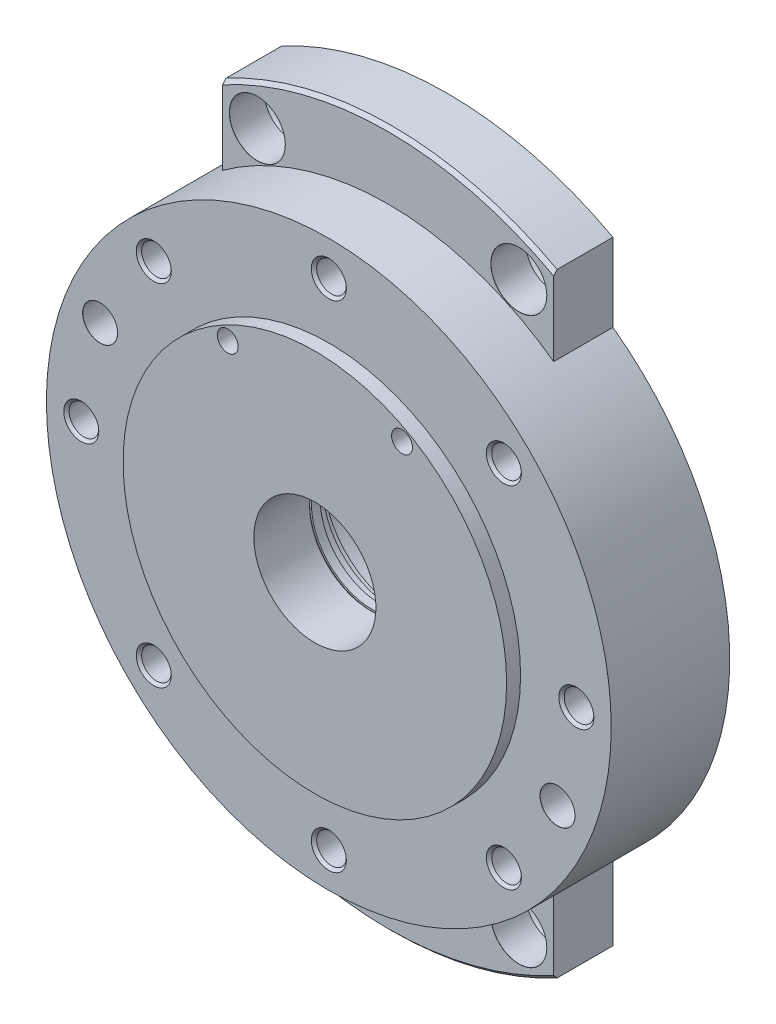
ISO-10303-21;
HEADER;
FILE_DESCRIPTION(('STEP AP214'),'2;1');
FILE_NAME('part.step','',(''),(''),'','','');
FILE_SCHEMA(('AUTOMOTIVE_DESIGN { 1 0 10303 214 1 1 1 1 }'));
ENDSEC;
DATA;
#1=APPLICATION_CONTEXT('core data for automotive mechanical design processes');
#2=APPLICATION_PROTOCOL_DEFINITION('international standard','automotive_design',2000,#1);
#3=PRODUCT_CONTEXT('',#1,'mechanical');
#4=PRODUCT('Part','Part','',(#3));
#5=PRODUCT_RELATED_PRODUCT_CATEGORY('part','',(#4));
#6=PRODUCT_DEFINITION_FORMATION('','',#4);
#7=PRODUCT_DEFINITION_CONTEXT('part definition',#1,'design');
#8=PRODUCT_DEFINITION('design','',#6,#7);
#9=PRODUCT_DEFINITION_SHAPE('','',#8);
#10=(LENGTH_UNIT() NAMED_UNIT(*) SI_UNIT(.MILLI.,.METRE.));
#11=(NAMED_UNIT(*) PLANE_ANGLE_UNIT() SI_UNIT($,.RADIAN.));
#12=(NAMED_UNIT(*) SI_UNIT($,.STERADIAN.) SOLID_ANGLE_UNIT());
#13=UNCERTAINTY_MEASURE_WITH_UNIT(LENGTH_MEASURE(1.E-05),#10,'distance_accuracy_value','');
#14=(GEOMETRIC_REPRESENTATION_CONTEXT(3) GLOBAL_UNCERTAINTY_ASSIGNED_CONTEXT((#13)) GLOBAL_UNIT_ASSIGNED_CONTEXT((#10,
#11,#12)) REPRESENTATION_CONTEXT('',''));
#15=CARTESIAN_POINT('',(0.,0.,0.));
#16=DIRECTION('',(0.,0.,1.));
#17=DIRECTION('',(1.,0.,0.));
#18=AXIS2_PLACEMENT_3D('',#15,#16,#17);
#19=CARTESIAN_POINT('',(0.,0.,17.));
#20=DIRECTION('',(0.,0.,1.));
#21=DIRECTION('',(1.,0.,0.));
#22=AXIS2_PLACEMENT_3D('',#19,#20,#21);
#23=PLANE('',#22);
#24=CARTESIAN_POINT('',(37.5,81.,17.));
#25=DIRECTION('',(0.,0.,1.));
#26=DIRECTION('',(1.,0.,0.));
#27=AXIS2_PLACEMENT_3D('',#24,#25,#26);
#28=CIRCLE('',#27,8.025);
#29=CARTESIAN_POINT('',(45.525,81.,17.));
#30=VERTEX_POINT('',#29);
#31=EDGE_CURVE('E358',#30,#30,#28,.T.);
#32=ORIENTED_EDGE('',*,*,#31,.F.);
#33=EDGE_LOOP('',(#32));
#34=FACE_BOUND('',#33,.T.);
#35=CARTESIAN_POINT('',(-37.5,81.,17.));
#36=DIRECTION('',(0.,0.,1.));
#37=DIRECTION('',(1.,0.,0.));
#38=AXIS2_PLACEMENT_3D('',#35,#36,#37);
#39=CIRCLE('',#38,8.025);
#40=CARTESIAN_POINT('',(-29.475,81.,17.));
#41=VERTEX_POINT('',#40);
#42=EDGE_CURVE('E381',#41,#41,#39,.T.);
#43=ORIENTED_EDGE('',*,*,#42,.F.);
#44=EDGE_LOOP('',(#43));
#45=FACE_BOUND('',#44,.T.);
#46=DIRECTION('',(0.,1.,0.));
#47=VECTOR('',#46,1.);
#48=CARTESIAN_POINT('',(47.5,0.,17.));
#49=LINE('',#48,#47);
#50=CARTESIAN_POINT('',(47.5,65.6105936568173,17.));
#51=VERTEX_POINT('',#50);
#52=CARTESIAN_POINT('',(47.5,86.8605203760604,17.));
#53=VERTEX_POINT('',#52);
#54=EDGE_CURVE('E408',#51,#53,#49,.T.);
#55=ORIENTED_EDGE('',*,*,#54,.T.);
#56=CARTESIAN_POINT('',(0.,0.,17.));
#57=DIRECTION('',(0.,0.,1.));
#58=DIRECTION('',(1.,0.,0.));
#59=AXIS2_PLACEMENT_3D('',#56,#57,#58);
#60=CIRCLE('',#59,99.);
#61=CARTESIAN_POINT('',(-47.5,86.8605203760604,17.));
#62=VERTEX_POINT('',#61);
#63=EDGE_CURVE('E463',#53,#62,#60,.T.);
#64=ORIENTED_EDGE('',*,*,#63,.T.);
#65=DIRECTION('',(0.,1.,0.));
#66=VECTOR('',#65,1.);
#67=CARTESIAN_POINT('',(-47.5,0.,17.));
#68=LINE('',#67,#66);
#69=CARTESIAN_POINT('',(-47.5,65.6105936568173,17.));
#70=VERTEX_POINT('',#69);
#71=EDGE_CURVE('E402',#70,#62,#68,.T.);
#72=ORIENTED_EDGE('',*,*,#71,.F.);
#73=CARTESIAN_POINT('',(0.,0.,17.));
#74=DIRECTION('',(0.,0.,1.));
#75=DIRECTION('',(1.,0.,0.));
#76=AXIS2_PLACEMENT_3D('',#73,#74,#75);
#77=CIRCLE('',#76,81.);
#78=EDGE_CURVE('E393',#51,#70,#77,.T.);
#79=ORIENTED_EDGE('',*,*,#78,.F.);
#80=EDGE_LOOP('',(#55,#64,#72,#79));
#81=FACE_BOUND('',#80,.T.);
#82=ADVANCED_FACE('F52',(#34,#45,#81),#23,.T.);
#83=CARTESIAN_POINT('',(-47.5,0.,17.));
#84=DIRECTION('',(-1.,0.,0.));
#85=DIRECTION('',(0.,0.,1.));
#86=AXIS2_PLACEMENT_3D('',#83,#84,#85);
#87=PLANE('',#86);
#88=ORIENTED_EDGE('',*,*,#71,.T.);
#89=CARTESIAN_POINT('',(-47.5,86.8605203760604,17.));
#90=CARTESIAN_POINT('',(-47.5,87.0503194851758,16.8334728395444));
#91=CARTESIAN_POINT('',(-47.5,87.2400573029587,16.6668759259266));
#92=CARTESIAN_POINT('',(-47.5,87.6194103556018,16.3335425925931));
#93=CARTESIAN_POINT('',(-47.5,87.8090255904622,16.1668061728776));
#94=CARTESIAN_POINT('',(-47.5,87.9985795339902,16.));
#95=B_SPLINE_CURVE_WITH_KNOTS('',3,(#89,#90,#91,#92,#93,#94),.UNSPECIFIED.,.F.,.F.,(4,2,4),(0.,
0.757492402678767,1.51498480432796),.UNSPECIFIED.);
#96=CARTESIAN_POINT('',(-47.5,87.9985795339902,16.));
#97=VERTEX_POINT('',#96);
#98=EDGE_CURVE('E470',#62,#97,#95,.T.);
#99=ORIENTED_EDGE('',*,*,#98,.T.);
#100=DIRECTION('',(0.,0.,-1.));
#101=VECTOR('',#100,1.);
#102=CARTESIAN_POINT('',(-47.5,87.9985795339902,17.));
#103=LINE('',#102,#101);
#104=CARTESIAN_POINT('',(-47.5,87.9985795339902,0.));
#105=VERTEX_POINT('',#104);
#106=EDGE_CURVE('E415',#97,#105,#103,.T.);
#107=ORIENTED_EDGE('',*,*,#106,.T.);
#108=DIRECTION('',(0.,1.,0.));
#109=VECTOR('',#108,1.);
#110=CARTESIAN_POINT('',(-47.5,0.,0.));
#111=LINE('',#110,#109);
#112=CARTESIAN_POINT('',(-47.5,65.6105936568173,0.));
#113=VERTEX_POINT('',#112);
#114=EDGE_CURVE('E400',#113,#105,#111,.T.);
#115=ORIENTED_EDGE('',*,*,#114,.F.);
#116=DIRECTION('',(0.,0.,-1.));
#117=VECTOR('',#116,1.);
#118=CARTESIAN_POINT('',(-47.5,65.6105936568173,17.));
#119=LINE('',#118,#117);
#120=EDGE_CURVE('E449',#70,#113,#119,.T.);
#121=ORIENTED_EDGE('',*,*,#120,.F.);
#122=EDGE_LOOP('',(#88,#99,#107,#115,#121));
#123=FACE_BOUND('',#122,.T.);
#124=ADVANCED_FACE('F476',(#123),#87,.T.);
#125=CARTESIAN_POINT('',(-47.5,0.,17.));
#126=DIRECTION('',(-1.,0.,0.));
#127=DIRECTION('',(0.,0.,1.));
#128=AXIS2_PLACEMENT_3D('',#125,#126,#127);
#129=PLANE('',#128);
#130=DIRECTION('',(0.,0.,-1.));
#131=VECTOR('',#130,1.);
#132=CARTESIAN_POINT('',(-47.5,-87.9985795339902,17.));
#133=LINE('',#132,#131);
#134=CARTESIAN_POINT('',(-47.5,-87.9985795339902,16.));
#135=VERTEX_POINT('',#134);
#136=CARTESIAN_POINT('',(-47.5,-87.9985795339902,0.));
#137=VERTEX_POINT('',#136);
#138=EDGE_CURVE('E443',#135,#137,#133,.T.);
#139=ORIENTED_EDGE('',*,*,#138,.F.);
#140=CARTESIAN_POINT('',(-47.5,-87.9985795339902,16.));
#141=CARTESIAN_POINT('',(-47.5,-87.8090255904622,16.1668061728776));
#142=CARTESIAN_POINT('',(-47.5,-87.6194103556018,16.3335425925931));
#143=CARTESIAN_POINT('',(-47.5,-87.2400573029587,16.6668759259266));
#144=CARTESIAN_POINT('',(-47.5,-87.0503194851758,16.8334728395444));
#145=CARTESIAN_POINT('',(-47.5,-86.8605203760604,17.));
#146=B_SPLINE_CURVE_WITH_KNOTS('',3,(#140,#141,#142,#143,#144,#145),.UNSPECIFIED.,.F.,.F.,(4,2,
4),(0.,0.757492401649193,1.51498480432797),.UNSPECIFIED.);
#147=CARTESIAN_POINT('',(-47.5,-86.8605203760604,17.));
#148=VERTEX_POINT('',#147);
#149=EDGE_CURVE('E11',#135,#148,#146,.T.);
#150=ORIENTED_EDGE('',*,*,#149,.T.);
#151=DIRECTION('',(0.,1.,0.));
#152=VECTOR('',#151,1.);
#153=CARTESIAN_POINT('',(-47.5,0.,17.));
#154=LINE('',#153,#152);
#155=CARTESIAN_POINT('',(-47.5,-65.6105936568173,17.));
#156=VERTEX_POINT('',#155);
#157=EDGE_CURVE('E404',#148,#156,#154,.T.);
#158=ORIENTED_EDGE('',*,*,#157,.T.);
#159=DIRECTION('',(0.,0.,-1.));
#160=VECTOR('',#159,1.);
#161=CARTESIAN_POINT('',(-47.5,-65.6105936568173,17.));
#162=LINE('',#161,#160);
#163=CARTESIAN_POINT('',(-47.5,-65.6105936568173,0.));
#164=VERTEX_POINT('',#163);
#165=EDGE_CURVE('E447',#156,#164,#162,.T.);
#166=ORIENTED_EDGE('',*,*,#165,.T.);
#167=DIRECTION('',(0.,1.,0.));
#168=VECTOR('',#167,1.);
#169=CARTESIAN_POINT('',(-47.5,0.,0.));
#170=LINE('',#169,#168);
#171=EDGE_CURVE('E417',#137,#164,#170,.T.);
#172=ORIENTED_EDGE('',*,*,#171,.F.);
#173=EDGE_LOOP('',(#139,#150,#158,#166,#172));
#174=FACE_BOUND('',#173,.T.);
#175=ADVANCED_FACE('F523',(#174),#129,.T.);
#176=CARTESIAN_POINT('',(0.,0.,17.));
#177=DIRECTION('',(0.,0.,-1.));
#178=DIRECTION('',(-1.,0.,0.));
#179=AXIS2_PLACEMENT_3D('',#176,#177,#178);
#180=CYLINDRICAL_SURFACE('',#179,100.);
#181=DIRECTION('',(0.,0.,-1.));
#182=VECTOR('',#181,1.);
#183=CARTESIAN_POINT('',(47.5,-87.9985795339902,17.));
#184=LINE('',#183,#182);
#185=CARTESIAN_POINT('',(47.5,-87.9985795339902,16.));
#186=VERTEX_POINT('',#185);
#187=CARTESIAN_POINT('',(47.5,-87.9985795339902,0.));
#188=VERTEX_POINT('',#187);
#189=EDGE_CURVE('E445',#186,#188,#184,.T.);
#190=ORIENTED_EDGE('',*,*,#189,.F.);
#191=CARTESIAN_POINT('',(0.,0.,16.));
#192=DIRECTION('',(0.,0.,1.));
#193=DIRECTION('',(1.,0.,0.));
#194=AXIS2_PLACEMENT_3D('',#191,#192,#193);
#195=CIRCLE('',#194,100.);
#196=EDGE_CURVE('E63',#186,#135,#195,.F.);
#197=ORIENTED_EDGE('',*,*,#196,.T.);
#198=ORIENTED_EDGE('',*,*,#138,.T.);
#199=CARTESIAN_POINT('',(0.,0.,0.));
#200=DIRECTION('',(0.,0.,1.));
#201=DIRECTION('',(1.,0.,0.));
#202=AXIS2_PLACEMENT_3D('',#199,#200,#201);
#203=CIRCLE('',#202,100.);
#204=EDGE_CURVE('E423',#137,#188,#203,.T.);
#205=ORIENTED_EDGE('',*,*,#204,.T.);
#206=EDGE_LOOP('',(#190,#197,#198,#205));
#207=FACE_BOUND('',#206,.T.);
#208=ADVANCED_FACE('F514',(#207),#180,.T.);
#209=CARTESIAN_POINT('',(47.5,0.,17.));
#210=DIRECTION('',(-1.,0.,0.));
#211=DIRECTION('',(0.,0.,1.));
#212=AXIS2_PLACEMENT_3D('',#209,#210,#211);
#213=PLANE('',#212);
#214=DIRECTION('',(0.,1.,0.));
#215=VECTOR('',#214,1.);
#216=CARTESIAN_POINT('',(47.5,0.,17.));
#217=LINE('',#216,#215);
#218=CARTESIAN_POINT('',(47.5,-86.8605203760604,17.));
#219=VERTEX_POINT('',#218);
#220=CARTESIAN_POINT('',(47.5,-65.6105936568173,17.));
#221=VERTEX_POINT('',#220);
#222=EDGE_CURVE('E406',#219,#221,#217,.T.);
#223=ORIENTED_EDGE('',*,*,#222,.F.);
#224=CARTESIAN_POINT('',(47.5,-86.8605203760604,17.));
#225=CARTESIAN_POINT('',(47.5,-87.0503194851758,16.8334728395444));
#226=CARTESIAN_POINT('',(47.5,-87.2400573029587,16.6668759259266));
#227=CARTESIAN_POINT('',(47.5,-87.6194103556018,16.3335425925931));
#228=CARTESIAN_POINT('',(47.5,-87.8090255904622,16.1668061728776));
#229=CARTESIAN_POINT('',(47.5,-87.9985795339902,16.));
#230=B_SPLINE_CURVE_WITH_KNOTS('',3,(#224,#225,#226,#227,#228,#229),.UNSPECIFIED.,.F.,.F.,(4,2,
4),(0.,0.757492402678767,1.51498480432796),.UNSPECIFIED.);
#231=EDGE_CURVE('E76',#219,#186,#230,.T.);
#232=ORIENTED_EDGE('',*,*,#231,.T.);
#233=ORIENTED_EDGE('',*,*,#189,.T.);
#234=DIRECTION('',(0.,1.,0.));
#235=VECTOR('',#234,1.);
#236=CARTESIAN_POINT('',(47.5,0.,0.));
#237=LINE('',#236,#235);
#238=CARTESIAN_POINT('',(47.5,-65.6105936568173,0.));
#239=VERTEX_POINT('',#238);
#240=EDGE_CURVE('E425',#188,#239,#237,.T.);
#241=ORIENTED_EDGE('',*,*,#240,.T.);
#242=DIRECTION('',(0.,0.,-1.));
#243=VECTOR('',#242,1.);
#244=CARTESIAN_POINT('',(47.5,-65.6105936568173,17.));
#245=LINE('',#244,#243);
#246=EDGE_CURVE('E437',#221,#239,#245,.T.);
#247=ORIENTED_EDGE('',*,*,#246,.F.);
#248=EDGE_LOOP('',(#223,#232,#233,#241,#247));
#249=FACE_BOUND('',#248,.T.);
#250=ADVANCED_FACE('F507',(#249),#213,.F.);
#251=CARTESIAN_POINT('',(0.,0.,17.));
#252=DIRECTION('',(0.,0.,-1.));
#253=DIRECTION('',(-1.,0.,0.));
#254=AXIS2_PLACEMENT_3D('',#251,#252,#253);
#255=CYLINDRICAL_SURFACE('',#254,81.);
#256=CARTESIAN_POINT('',(0.,0.,0.));
#257=DIRECTION('',(0.,0.,1.));
#258=DIRECTION('',(1.,0.,0.));
#259=AXIS2_PLACEMENT_3D('',#256,#257,#258);
#260=CIRCLE('',#259,81.);
#261=CARTESIAN_POINT('',(47.5,65.6105936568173,0.));
#262=VERTEX_POINT('',#261);
#263=EDGE_CURVE('E428',#239,#262,#260,.T.);
#264=ORIENTED_EDGE('',*,*,#263,.T.);
#265=DIRECTION('',(0.,0.,-1.));
#266=VECTOR('',#265,1.);
#267=CARTESIAN_POINT('',(47.5,65.6105936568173,17.));
#268=LINE('',#267,#266);
#269=EDGE_CURVE('E436',#51,#262,#268,.T.);
#270=ORIENTED_EDGE('',*,*,#269,.F.);
#271=ORIENTED_EDGE('',*,*,#78,.T.);
#272=ORIENTED_EDGE('',*,*,#120,.T.);
#273=CARTESIAN_POINT('',(0.,0.,0.));
#274=DIRECTION('',(0.,0.,1.));
#275=DIRECTION('',(1.,0.,0.));
#276=AXIS2_PLACEMENT_3D('',#273,#274,#275);
#277=CIRCLE('',#276,81.);
#278=EDGE_CURVE('E414',#113,#164,#277,.T.);
#279=ORIENTED_EDGE('',*,*,#278,.T.);
#280=ORIENTED_EDGE('',*,*,#165,.F.);
#281=EDGE_CURVE('E399',#156,#221,#77,.T.);
#282=ORIENTED_EDGE('',*,*,#281,.T.);
#283=ORIENTED_EDGE('',*,*,#246,.T.);
#284=EDGE_LOOP('',(#264,#270,#271,#272,#279,#280,#282,#283));
#285=FACE_BOUND('',#284,.T.);
#286=CARTESIAN_POINT('',(0.,0.,34.));
#287=DIRECTION('',(0.,0.,1.));
#288=DIRECTION('',(1.,0.,0.));
#289=AXIS2_PLACEMENT_3D('',#286,#287,#288);
#290=CIRCLE('',#289,81.);
#291=CARTESIAN_POINT('',(81.,0.,34.));
#292=VERTEX_POINT('',#291);
#293=EDGE_CURVE('E392',#292,#292,#290,.T.);
#294=ORIENTED_EDGE('',*,*,#293,.F.);
#295=EDGE_LOOP('',(#294));
#296=FACE_BOUND('',#295,.T.);
#297=ADVANCED_FACE('F503',(#285,#296),#255,.T.);
#298=CARTESIAN_POINT('',(47.5,0.,17.));
#299=DIRECTION('',(-1.,0.,0.));
#300=DIRECTION('',(0.,0.,1.));
#301=AXIS2_PLACEMENT_3D('',#298,#299,#300);
#302=PLANE('',#301);
#303=DIRECTION('',(0.,0.,-1.));
#304=VECTOR('',#303,1.);
#305=CARTESIAN_POINT('',(47.5,87.9985795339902,17.));
#306=LINE('',#305,#304);
#307=CARTESIAN_POINT('',(47.5,87.9985795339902,16.));
#308=VERTEX_POINT('',#307);
#309=CARTESIAN_POINT('',(47.5,87.9985795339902,0.));
#310=VERTEX_POINT('',#309);
#311=EDGE_CURVE('E432',#308,#310,#306,.T.);
#312=ORIENTED_EDGE('',*,*,#311,.F.);
#313=CARTESIAN_POINT('',(47.5,87.9985795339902,16.));
#314=CARTESIAN_POINT('',(47.5,87.8090255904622,16.1668061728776));
#315=CARTESIAN_POINT('',(47.5,87.6194103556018,16.3335425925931));
#316=CARTESIAN_POINT('',(47.5,87.2400573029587,16.6668759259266));
#317=CARTESIAN_POINT('',(47.5,87.0503194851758,16.8334728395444));
#318=CARTESIAN_POINT('',(47.5,86.8605203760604,17.));
#319=B_SPLINE_CURVE_WITH_KNOTS('',3,(#313,#314,#315,#316,#317,#318),.UNSPECIFIED.,.F.,.F.,(4,2,
4),(0.,0.757492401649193,1.51498480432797),.UNSPECIFIED.);
#320=EDGE_CURVE('E486',#308,#53,#319,.T.);
#321=ORIENTED_EDGE('',*,*,#320,.T.);
#322=ORIENTED_EDGE('',*,*,#54,.F.);
#323=ORIENTED_EDGE('',*,*,#269,.T.);
#324=DIRECTION('',(0.,1.,0.));
#325=VECTOR('',#324,1.);
#326=CARTESIAN_POINT('',(47.5,0.,0.));
#327=LINE('',#326,#325);
#328=EDGE_CURVE('E426',#262,#310,#327,.T.);
#329=ORIENTED_EDGE('',*,*,#328,.T.);
#330=EDGE_LOOP('',(#312,#321,#322,#323,#329));
#331=FACE_BOUND('',#330,.T.);
#332=ADVANCED_FACE('F500',(#331),#302,.F.);
#333=CARTESIAN_POINT('',(0.,0.,17.));
#334=DIRECTION('',(0.,0.,-1.));
#335=DIRECTION('',(-1.,0.,0.));
#336=AXIS2_PLACEMENT_3D('',#333,#334,#335);
#337=CYLINDRICAL_SURFACE('',#336,100.);
#338=ORIENTED_EDGE('',*,*,#106,.F.);
#339=CARTESIAN_POINT('',(0.,0.,16.));
#340=DIRECTION('',(0.,0.,1.));
#341=DIRECTION('',(1.,0.,0.));
#342=AXIS2_PLACEMENT_3D('',#339,#340,#341);
#343=CIRCLE('',#342,100.);
#344=EDGE_CURVE('E473',#97,#308,#343,.F.);
#345=ORIENTED_EDGE('',*,*,#344,.T.);
#346=ORIENTED_EDGE('',*,*,#311,.T.);
#347=CARTESIAN_POINT('',(0.,0.,0.));
#348=DIRECTION('',(0.,0.,1.));
#349=DIRECTION('',(1.,0.,0.));
#350=AXIS2_PLACEMENT_3D('',#347,#348,#349);
#351=CIRCLE('',#350,100.);
#352=EDGE_CURVE('E403',#310,#105,#351,.T.);
#353=ORIENTED_EDGE('',*,*,#352,.T.);
#354=EDGE_LOOP('',(#338,#345,#346,#353));
#355=FACE_BOUND('',#354,.T.);
#356=ADVANCED_FACE('F505',(#355),#337,.T.);
#357=CARTESIAN_POINT('',(37.5,-81.,17.));
#358=DIRECTION('',(0.,0.,1.));
#359=DIRECTION('',(1.,0.,0.));
#360=AXIS2_PLACEMENT_3D('',#357,#358,#359);
#361=CIRCLE('',#360,8.025);
#362=CARTESIAN_POINT('',(45.525,-81.,17.));
#363=VERTEX_POINT('',#362);
#364=EDGE_CURVE('E366',#363,#363,#361,.T.);
#365=ORIENTED_EDGE('',*,*,#364,.F.);
#366=EDGE_LOOP('',(#365));
#367=FACE_BOUND('',#366,.T.);
#368=CARTESIAN_POINT('',(-37.5,-81.,17.));
#369=DIRECTION('',(0.,0.,1.));
#370=DIRECTION('',(1.,0.,0.));
#371=AXIS2_PLACEMENT_3D('',#368,#369,#370);
#372=CIRCLE('',#371,8.025);
#373=CARTESIAN_POINT('',(-29.475,-81.,17.));
#374=VERTEX_POINT('',#373);
#375=EDGE_CURVE('E374',#374,#374,#372,.T.);
#376=ORIENTED_EDGE('',*,*,#375,.F.);
#377=EDGE_LOOP('',(#376));
#378=FACE_BOUND('',#377,.T.);
#379=ORIENTED_EDGE('',*,*,#157,.F.);
#380=CARTESIAN_POINT('',(0.,0.,17.));
#381=DIRECTION('',(0.,0.,1.));
#382=DIRECTION('',(1.,0.,0.));
#383=AXIS2_PLACEMENT_3D('',#380,#381,#382);
#384=CIRCLE('',#383,99.);
#385=EDGE_CURVE('E492',#148,#219,#384,.T.);
#386=ORIENTED_EDGE('',*,*,#385,.T.);
#387=ORIENTED_EDGE('',*,*,#222,.T.);
#388=ORIENTED_EDGE('',*,*,#281,.F.);
#389=EDGE_LOOP('',(#379,#386,#387,#388));
#390=FACE_BOUND('',#389,.T.);
#391=ADVANCED_FACE('F533',(#367,#378,#390),#23,.T.);
#392=CARTESIAN_POINT('',(0.,0.,0.));
#393=DIRECTION('',(0.,0.,1.));
#394=DIRECTION('',(1.,0.,0.));
#395=AXIS2_PLACEMENT_3D('',#392,#393,#394);
#396=PLANE('',#395);
#397=CARTESIAN_POINT('',(0.,0.,0.));
#398=DIRECTION('',(0.,0.,-1.));
#399=DIRECTION('',(-1.,0.,0.));
#400=AXIS2_PLACEMENT_3D('',#397,#398,#399);
#401=CIRCLE('',#400,37.);
#402=CARTESIAN_POINT('',(-37.,0.,0.));
#403=VERTEX_POINT('',#402);
#404=EDGE_CURVE('E981',#403,#403,#401,.T.);
#405=ORIENTED_EDGE('',*,*,#404,.F.);
#406=EDGE_LOOP('',(#405));
#407=FACE_BOUND('',#406,.T.);
#408=CARTESIAN_POINT('',(12.9409522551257,-48.2962913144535,0.));
#409=DIRECTION('',(0.,0.,-1.));
#410=DIRECTION('',(-1.,0.,0.));
#411=AXIS2_PLACEMENT_3D('',#408,#409,#410);
#412=CIRCLE('',#411,6.5);
#413=CARTESIAN_POINT('',(6.44095225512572,-48.2962913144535,0.));
#414=VERTEX_POINT('',#413);
#415=EDGE_CURVE('E271',#414,#414,#412,.T.);
#416=ORIENTED_EDGE('',*,*,#415,.F.);
#417=EDGE_LOOP('',(#416));
#418=FACE_BOUND('',#417,.T.);
#419=CARTESIAN_POINT('',(25.,45.,0.));
#420=DIRECTION('',(0.,0.,-1.));
#421=DIRECTION('',(-1.,0.,0.));
#422=AXIS2_PLACEMENT_3D('',#419,#420,#421);
#423=CIRCLE('',#422,6.5);
#424=CARTESIAN_POINT('',(18.5,45.,0.));
#425=VERTEX_POINT('',#424);
#426=EDGE_CURVE('E296',#425,#425,#423,.T.);
#427=ORIENTED_EDGE('',*,*,#426,.F.);
#428=EDGE_LOOP('',(#427));
#429=FACE_BOUND('',#428,.T.);
#430=CARTESIAN_POINT('',(-25.,45.,0.));
#431=DIRECTION('',(0.,0.,-1.));
#432=DIRECTION('',(-1.,0.,0.));
#433=AXIS2_PLACEMENT_3D('',#430,#431,#432);
#434=CIRCLE('',#433,6.5);
#435=CARTESIAN_POINT('',(-31.5,45.,0.));
#436=VERTEX_POINT('',#435);
#437=EDGE_CURVE('E301',#436,#436,#434,.T.);
#438=ORIENTED_EDGE('',*,*,#437,.F.);
#439=EDGE_LOOP('',(#438));
#440=FACE_BOUND('',#439,.T.);
#441=CARTESIAN_POINT('',(-37.5,52.,0.));
#442=DIRECTION('',(0.,0.,-1.));
#443=DIRECTION('',(-1.,0.,0.));
#444=AXIS2_PLACEMENT_3D('',#441,#442,#443);
#445=CIRCLE('',#444,4.025);
#446=CARTESIAN_POINT('',(-41.525,52.,0.));
#447=VERTEX_POINT('',#446);
#448=EDGE_CURVE('E300',#447,#447,#445,.T.);
#449=ORIENTED_EDGE('',*,*,#448,.F.);
#450=EDGE_LOOP('',(#449));
#451=FACE_BOUND('',#450,.T.);
#452=CARTESIAN_POINT('',(37.5,-52.,0.));
#453=DIRECTION('',(0.,0.,-1.));
#454=DIRECTION('',(-1.,0.,0.));
#455=AXIS2_PLACEMENT_3D('',#452,#453,#454);
#456=CIRCLE('',#455,4.025);
#457=CARTESIAN_POINT('',(33.475,-52.,0.));
#458=VERTEX_POINT('',#457);
#459=EDGE_CURVE('E317',#458,#458,#456,.T.);
#460=ORIENTED_EDGE('',*,*,#459,.F.);
#461=EDGE_LOOP('',(#460));
#462=FACE_BOUND('',#461,.T.);
#463=CARTESIAN_POINT('',(37.5,52.,0.));
#464=DIRECTION('',(0.,0.,-1.));
#465=DIRECTION('',(-1.,0.,0.));
#466=AXIS2_PLACEMENT_3D('',#463,#464,#465);
#467=CIRCLE('',#466,4.025);
#468=CARTESIAN_POINT('',(33.475,52.,0.));
#469=VERTEX_POINT('',#468);
#470=EDGE_CURVE('E322',#469,#469,#467,.T.);
#471=ORIENTED_EDGE('',*,*,#470,.F.);
#472=EDGE_LOOP('',(#471));
#473=FACE_BOUND('',#472,.T.);
#474=CARTESIAN_POINT('',(-37.5,-52.,0.));
#475=DIRECTION('',(0.,0.,-1.));
#476=DIRECTION('',(-1.,0.,0.));
#477=AXIS2_PLACEMENT_3D('',#474,#475,#476);
#478=CIRCLE('',#477,4.025);
#479=CARTESIAN_POINT('',(-41.525,-52.,0.));
#480=VERTEX_POINT('',#479);
#481=EDGE_CURVE('E333',#480,#480,#478,.T.);
#482=ORIENTED_EDGE('',*,*,#481,.F.);
#483=EDGE_LOOP('',(#482));
#484=FACE_BOUND('',#483,.T.);
#485=CARTESIAN_POINT('',(37.5,81.,0.));
#486=DIRECTION('',(0.,0.,-1.));
#487=DIRECTION('',(-1.,0.,0.));
#488=AXIS2_PLACEMENT_3D('',#485,#486,#487);
#489=CIRCLE('',#488,5.5);
#490=CARTESIAN_POINT('',(32.,81.,0.));
#491=VERTEX_POINT('',#490);
#492=EDGE_CURVE('E345',#491,#491,#489,.T.);
#493=ORIENTED_EDGE('',*,*,#492,.F.);
#494=EDGE_LOOP('',(#493));
#495=FACE_BOUND('',#494,.T.);
#496=CARTESIAN_POINT('',(37.5,-81.,0.));
#497=DIRECTION('',(0.,0.,-1.));
#498=DIRECTION('',(-1.,0.,0.));
#499=AXIS2_PLACEMENT_3D('',#496,#497,#498);
#500=CIRCLE('',#499,5.5);
#501=CARTESIAN_POINT('',(32.,-81.,0.));
#502=VERTEX_POINT('',#501);
#503=EDGE_CURVE('E348',#502,#502,#500,.T.);
#504=ORIENTED_EDGE('',*,*,#503,.F.);
#505=EDGE_LOOP('',(#504));
#506=FACE_BOUND('',#505,.T.);
#507=CARTESIAN_POINT('',(-37.5,-81.,0.));
#508=DIRECTION('',(0.,0.,-1.));
#509=DIRECTION('',(-1.,0.,0.));
#510=AXIS2_PLACEMENT_3D('',#507,#508,#509);
#511=CIRCLE('',#510,5.5);
#512=CARTESIAN_POINT('',(-43.,-81.,0.));
#513=VERTEX_POINT('',#512);
#514=EDGE_CURVE('E343',#513,#513,#511,.T.);
#515=ORIENTED_EDGE('',*,*,#514,.F.);
#516=EDGE_LOOP('',(#515));
#517=FACE_BOUND('',#516,.T.);
#518=CARTESIAN_POINT('',(-37.5,81.,0.));
#519=DIRECTION('',(0.,0.,-1.));
#520=DIRECTION('',(-1.,0.,0.));
#521=AXIS2_PLACEMENT_3D('',#518,#519,#520);
#522=CIRCLE('',#521,5.5);
#523=CARTESIAN_POINT('',(-43.,81.,0.));
#524=VERTEX_POINT('',#523);
#525=EDGE_CURVE('E350',#524,#524,#522,.T.);
#526=ORIENTED_EDGE('',*,*,#525,.F.);
#527=EDGE_LOOP('',(#526));
#528=FACE_BOUND('',#527,.T.);
#529=ORIENTED_EDGE('',*,*,#114,.T.);
#530=ORIENTED_EDGE('',*,*,#352,.F.);
#531=ORIENTED_EDGE('',*,*,#328,.F.);
#532=ORIENTED_EDGE('',*,*,#263,.F.);
#533=ORIENTED_EDGE('',*,*,#240,.F.);
#534=ORIENTED_EDGE('',*,*,#204,.F.);
#535=ORIENTED_EDGE('',*,*,#171,.T.);
#536=ORIENTED_EDGE('',*,*,#278,.F.);
#537=EDGE_LOOP('',(#529,#530,#531,#532,#533,#534,#535,#536));
#538=FACE_BOUND('',#537,.T.);
#539=ADVANCED_FACE('F543',(#407,#418,#429,#440,#451,#462,#473,#484,#495,#506,#517,#528,#538),
#396,.F.);
#540=CARTESIAN_POINT('',(0.,0.,34.));
#541=DIRECTION('',(0.,0.,1.));
#542=DIRECTION('',(1.,0.,0.));
#543=AXIS2_PLACEMENT_3D('',#540,#541,#542);
#544=PLANE('',#543);
#545=CARTESIAN_POINT('',(65.5954468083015,-27.170523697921,34.));
#546=DIRECTION('',(0.,0.,1.));
#547=DIRECTION('',(1.,0.,0.));
#548=AXIS2_PLACEMENT_3D('',#545,#546,#547);
#549=CIRCLE('',#548,5.025);
#550=CARTESIAN_POINT('',(70.6204468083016,-27.170523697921,34.));
#551=VERTEX_POINT('',#550);
#552=EDGE_CURVE('E189',#551,#551,#549,.T.);
#553=ORIENTED_EDGE('',*,*,#552,.F.);
#554=EDGE_LOOP('',(#553));
#555=FACE_BOUND('',#554,.T.);
#556=CARTESIAN_POINT('',(-65.5954468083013,27.1705236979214,34.));
#557=DIRECTION('',(0.,0.,1.));
#558=DIRECTION('',(1.,0.,0.));
#559=AXIS2_PLACEMENT_3D('',#556,#557,#558);
#560=CIRCLE('',#559,5.025);
#561=CARTESIAN_POINT('',(-60.5704468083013,27.1705236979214,34.));
#562=VERTEX_POINT('',#561);
#563=EDGE_CURVE('E181',#562,#562,#560,.T.);
#564=ORIENTED_EDGE('',*,*,#563,.F.);
#565=EDGE_LOOP('',(#564));
#566=FACE_BOUND('',#565,.T.);
#567=CARTESIAN_POINT('',(50.2045814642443,50.2045814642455,34.));
#568=DIRECTION('',(0.,0.,1.));
#569=DIRECTION('',(1.,0.,0.));
#570=AXIS2_PLACEMENT_3D('',#567,#568,#569);
#571=CIRCLE('',#570,5.025);
#572=CARTESIAN_POINT('',(55.2295814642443,50.2045814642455,34.));
#573=VERTEX_POINT('',#572);
#574=EDGE_CURVE('E200',#573,#573,#571,.T.);
#575=ORIENTED_EDGE('',*,*,#574,.F.);
#576=EDGE_LOOP('',(#575));
#577=FACE_BOUND('',#576,.T.);
#578=CARTESIAN_POINT('',(71.,7.43685525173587E-13,34.));
#579=DIRECTION('',(0.,0.,1.));
#580=DIRECTION('',(1.,0.,0.));
#581=AXIS2_PLACEMENT_3D('',#578,#579,#580);
#582=CIRCLE('',#581,5.025);
#583=CARTESIAN_POINT('',(76.025,7.43685525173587E-13,34.));
#584=VERTEX_POINT('',#583);
#585=EDGE_CURVE('E207',#584,#584,#582,.T.);
#586=ORIENTED_EDGE('',*,*,#585,.F.);
#587=EDGE_LOOP('',(#586));
#588=FACE_BOUND('',#587,.T.);
#589=CARTESIAN_POINT('',(50.2045814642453,-50.2045814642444,34.));
#590=DIRECTION('',(0.,0.,1.));
#591=DIRECTION('',(1.,0.,0.));
#592=AXIS2_PLACEMENT_3D('',#589,#590,#591);
#593=CIRCLE('',#592,5.025);
#594=CARTESIAN_POINT('',(55.2295814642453,-50.2045814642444,34.));
#595=VERTEX_POINT('',#594);
#596=EDGE_CURVE('E212',#595,#595,#593,.T.);
#597=ORIENTED_EDGE('',*,*,#596,.F.);
#598=EDGE_LOOP('',(#597));
#599=FACE_BOUND('',#598,.T.);
#600=CARTESIAN_POINT('',(0.,-71.,34.));
#601=DIRECTION('',(0.,0.,1.));
#602=DIRECTION('',(1.,0.,0.));
#603=AXIS2_PLACEMENT_3D('',#600,#601,#602);
#604=CIRCLE('',#603,5.025);
#605=CARTESIAN_POINT('',(5.025,-71.,34.));
#606=VERTEX_POINT('',#605);
#607=EDGE_CURVE('E223',#606,#606,#604,.T.);
#608=ORIENTED_EDGE('',*,*,#607,.F.);
#609=EDGE_LOOP('',(#608));
#610=FACE_BOUND('',#609,.T.);
#611=CARTESIAN_POINT('',(-50.2045814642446,-50.2045814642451,34.));
#612=DIRECTION('',(0.,0.,1.));
#613=DIRECTION('',(1.,0.,0.));
#614=AXIS2_PLACEMENT_3D('',#611,#612,#613);
#615=CIRCLE('',#614,5.025);
#616=CARTESIAN_POINT('',(-45.1795814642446,-50.2045814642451,34.));
#617=VERTEX_POINT('',#616);
#618=EDGE_CURVE('E231',#617,#617,#615,.T.);
#619=ORIENTED_EDGE('',*,*,#618,.F.);
#620=EDGE_LOOP('',(#619));
#621=FACE_BOUND('',#620,.T.);
#622=CARTESIAN_POINT('',(-71.,-2.47895175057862E-13,34.));
#623=DIRECTION('',(0.,0.,1.));
#624=DIRECTION('',(1.,0.,0.));
#625=AXIS2_PLACEMENT_3D('',#622,#623,#624);
#626=CIRCLE('',#625,5.025);
#627=CARTESIAN_POINT('',(-65.975,-2.47895175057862E-13,34.));
#628=VERTEX_POINT('',#627);
#629=EDGE_CURVE('E245',#628,#628,#626,.T.);
#630=ORIENTED_EDGE('',*,*,#629,.F.);
#631=EDGE_LOOP('',(#630));
#632=FACE_BOUND('',#631,.T.);
#633=CARTESIAN_POINT('',(-50.204581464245,50.2045814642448,34.));
#634=DIRECTION('',(0.,0.,1.));
#635=DIRECTION('',(1.,0.,0.));
#636=AXIS2_PLACEMENT_3D('',#633,#634,#635);
#637=CIRCLE('',#636,5.025);
#638=CARTESIAN_POINT('',(-45.179581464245,50.2045814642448,34.));
#639=VERTEX_POINT('',#638);
#640=EDGE_CURVE('E252',#639,#639,#637,.T.);
#641=ORIENTED_EDGE('',*,*,#640,.F.);
#642=EDGE_LOOP('',(#641));
#643=FACE_BOUND('',#642,.T.);
#644=CARTESIAN_POINT('',(0.,71.,34.));
#645=DIRECTION('',(0.,0.,1.));
#646=DIRECTION('',(1.,0.,0.));
#647=AXIS2_PLACEMENT_3D('',#644,#645,#646);
#648=CIRCLE('',#647,5.025);
#649=CARTESIAN_POINT('',(5.025,71.,34.));
#650=VERTEX_POINT('',#649);
#651=EDGE_CURVE('E257',#650,#650,#648,.T.);
#652=ORIENTED_EDGE('',*,*,#651,.F.);
#653=EDGE_LOOP('',(#652));
#654=FACE_BOUND('',#653,.T.);
#655=CARTESIAN_POINT('',(0.,0.,34.));
#656=DIRECTION('',(0.,0.,1.));
#657=DIRECTION('',(1.,0.,0.));
#658=AXIS2_PLACEMENT_3D('',#655,#656,#657);
#659=CIRCLE('',#658,55.);
#660=CARTESIAN_POINT('',(55.,0.,34.));
#661=VERTEX_POINT('',#660);
#662=EDGE_CURVE('E284',#661,#661,#659,.T.);
#663=ORIENTED_EDGE('',*,*,#662,.F.);
#664=EDGE_LOOP('',(#663));
#665=FACE_BOUND('',#664,.T.);
#666=ORIENTED_EDGE('',*,*,#293,.T.);
#667=EDGE_LOOP('',(#666));
#668=FACE_BOUND('',#667,.T.);
#669=ADVANCED_FACE('F548',(#555,#566,#577,#588,#599,#610,#621,#632,#643,#654,#665,#668),#544,.T.);
#670=CARTESIAN_POINT('',(-37.5,81.,7.00000000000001));
#671=DIRECTION('',(0.,0.,1.));
#672=DIRECTION('',(1.,0.,0.));
#673=AXIS2_PLACEMENT_3D('',#670,#671,#672);
#674=CONICAL_SURFACE('',#673,7.99999999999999,1.02974425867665);
#675=CARTESIAN_POINT('',(-37.5,81.,5.49784845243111));
#676=DIRECTION('',(0.,0.,1.));
#677=DIRECTION('',(1.,0.,0.));
#678=AXIS2_PLACEMENT_3D('',#675,#676,#677);
#679=CIRCLE('',#678,5.5);
#680=CARTESIAN_POINT('',(-32.,81.,5.49784845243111));
#681=VERTEX_POINT('',#680);
#682=EDGE_CURVE('E359',#681,#681,#679,.F.);
#683=ORIENTED_EDGE('',*,*,#682,.T.);
#684=EDGE_LOOP('',(#683));
#685=FACE_BOUND('',#684,.T.);
#686=CARTESIAN_POINT('',(-37.5,81.,7.00000000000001));
#687=DIRECTION('',(0.,0.,1.));
#688=DIRECTION('',(1.,0.,0.));
#689=AXIS2_PLACEMENT_3D('',#686,#687,#688);
#690=CIRCLE('',#689,7.99999999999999);
#691=CARTESIAN_POINT('',(-29.5,81.,7.00000000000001));
#692=VERTEX_POINT('',#691);
#693=EDGE_CURVE('E387',#692,#692,#690,.T.);
#694=ORIENTED_EDGE('',*,*,#693,.T.);
#695=EDGE_LOOP('',(#694));
#696=FACE_BOUND('',#695,.T.);
#697=ADVANCED_FACE('F588',(#685,#696),#674,.F.);
#698=CARTESIAN_POINT('',(-37.5,81.,17.));
#699=DIRECTION('',(0.,0.,1.));
#700=DIRECTION('',(1.,0.,0.));
#701=AXIS2_PLACEMENT_3D('',#698,#699,#700);
#702=CYLINDRICAL_SURFACE('',#701,7.99999999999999);
#703=ORIENTED_EDGE('',*,*,#693,.F.);
#704=EDGE_LOOP('',(#703));
#705=FACE_BOUND('',#704,.T.);
#706=CARTESIAN_POINT('',(-37.5,81.,16.975));
#707=DIRECTION('',(0.,0.,1.));
#708=DIRECTION('',(1.,0.,0.));
#709=AXIS2_PLACEMENT_3D('',#706,#707,#708);
#710=CIRCLE('',#709,7.99999999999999);
#711=CARTESIAN_POINT('',(-29.5,81.,16.975));
#712=VERTEX_POINT('',#711);
#713=EDGE_CURVE('E386',#712,#712,#710,.T.);
#714=ORIENTED_EDGE('',*,*,#713,.T.);
#715=EDGE_LOOP('',(#714));
#716=FACE_BOUND('',#715,.T.);
#717=ADVANCED_FACE('F593',(#705,#716),#702,.F.);
#718=CARTESIAN_POINT('',(-37.5,81.,17.));
#719=DIRECTION('',(0.,0.,1.));
#720=DIRECTION('',(1.,0.,0.));
#721=AXIS2_PLACEMENT_3D('',#718,#719,#720);
#722=CONICAL_SURFACE('',#721,8.025,0.785398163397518);
#723=ORIENTED_EDGE('',*,*,#713,.F.);
#724=EDGE_LOOP('',(#723));
#725=FACE_BOUND('',#724,.T.);
#726=ORIENTED_EDGE('',*,*,#42,.T.);
#727=EDGE_LOOP('',(#726));
#728=FACE_BOUND('',#727,.T.);
#729=ADVANCED_FACE('F601',(#725,#728),#722,.F.);
#730=CARTESIAN_POINT('',(-37.5,-81.,7.00000000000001));
#731=DIRECTION('',(0.,0.,1.));
#732=DIRECTION('',(1.,0.,0.));
#733=AXIS2_PLACEMENT_3D('',#730,#731,#732);
#734=CONICAL_SURFACE('',#733,7.99999999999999,1.02974425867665);
#735=CARTESIAN_POINT('',(-37.5,-81.,5.49784845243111));
#736=DIRECTION('',(0.,0.,1.));
#737=DIRECTION('',(1.,0.,0.));
#738=AXIS2_PLACEMENT_3D('',#735,#736,#737);
#739=CIRCLE('',#738,5.5);
#740=CARTESIAN_POINT('',(-32.,-81.,5.49784845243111));
#741=VERTEX_POINT('',#740);
#742=EDGE_CURVE('E452',#741,#741,#739,.F.);
#743=ORIENTED_EDGE('',*,*,#742,.T.);
#744=EDGE_LOOP('',(#743));
#745=FACE_BOUND('',#744,.T.);
#746=CARTESIAN_POINT('',(-37.5,-81.,7.00000000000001));
#747=DIRECTION('',(0.,0.,1.));
#748=DIRECTION('',(1.,0.,0.));
#749=AXIS2_PLACEMENT_3D('',#746,#747,#748);
#750=CIRCLE('',#749,7.99999999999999);
#751=CARTESIAN_POINT('',(-29.5,-81.,7.00000000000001));
#752=VERTEX_POINT('',#751);
#753=EDGE_CURVE('E382',#752,#752,#750,.T.);
#754=ORIENTED_EDGE('',*,*,#753,.T.);
#755=EDGE_LOOP('',(#754));
#756=FACE_BOUND('',#755,.T.);
#757=ADVANCED_FACE('F606',(#745,#756),#734,.F.);
#758=CARTESIAN_POINT('',(-37.5,-81.,17.));
#759=DIRECTION('',(0.,0.,1.));
#760=DIRECTION('',(1.,0.,0.));
#761=AXIS2_PLACEMENT_3D('',#758,#759,#760);
#762=CYLINDRICAL_SURFACE('',#761,7.99999999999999);
#763=ORIENTED_EDGE('',*,*,#753,.F.);
#764=EDGE_LOOP('',(#763));
#765=FACE_BOUND('',#764,.T.);
#766=CARTESIAN_POINT('',(-37.5,-81.,16.975));
#767=DIRECTION('',(0.,0.,1.));
#768=DIRECTION('',(1.,0.,0.));
#769=AXIS2_PLACEMENT_3D('',#766,#767,#768);
#770=CIRCLE('',#769,7.99999999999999);
#771=CARTESIAN_POINT('',(-29.5,-81.,16.975));
#772=VERTEX_POINT('',#771);
#773=EDGE_CURVE('E377',#772,#772,#770,.T.);
#774=ORIENTED_EDGE('',*,*,#773,.T.);
#775=EDGE_LOOP('',(#774));
#776=FACE_BOUND('',#775,.T.);
#777=ADVANCED_FACE('F609',(#765,#776),#762,.F.);
#778=CARTESIAN_POINT('',(-37.5,-81.,17.));
#779=DIRECTION('',(0.,0.,1.));
#780=DIRECTION('',(1.,0.,0.));
#781=AXIS2_PLACEMENT_3D('',#778,#779,#780);
#782=CONICAL_SURFACE('',#781,8.025,0.785398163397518);
#783=ORIENTED_EDGE('',*,*,#773,.F.);
#784=EDGE_LOOP('',(#783));
#785=FACE_BOUND('',#784,.T.);
#786=ORIENTED_EDGE('',*,*,#375,.T.);
#787=EDGE_LOOP('',(#786));
#788=FACE_BOUND('',#787,.T.);
#789=ADVANCED_FACE('F613',(#785,#788),#782,.F.);
#790=CARTESIAN_POINT('',(37.5,-81.,7.00000000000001));
#791=DIRECTION('',(0.,0.,1.));
#792=DIRECTION('',(1.,0.,0.));
#793=AXIS2_PLACEMENT_3D('',#790,#791,#792);
#794=CONICAL_SURFACE('',#793,7.99999999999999,1.02974425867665);
#795=CARTESIAN_POINT('',(37.5,-81.,5.49784845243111));
#796=DIRECTION('',(0.,0.,1.));
#797=DIRECTION('',(1.,0.,0.));
#798=AXIS2_PLACEMENT_3D('',#795,#796,#797);
#799=CIRCLE('',#798,5.5);
#800=CARTESIAN_POINT('',(43.,-81.,5.49784845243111));
#801=VERTEX_POINT('',#800);
#802=EDGE_CURVE('E451',#801,#801,#799,.F.);
#803=ORIENTED_EDGE('',*,*,#802,.T.);
#804=EDGE_LOOP('',(#803));
#805=FACE_BOUND('',#804,.T.);
#806=CARTESIAN_POINT('',(37.5,-81.,7.00000000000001));
#807=DIRECTION('',(0.,0.,1.));
#808=DIRECTION('',(1.,0.,0.));
#809=AXIS2_PLACEMENT_3D('',#806,#807,#808);
#810=CIRCLE('',#809,7.99999999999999);
#811=CARTESIAN_POINT('',(45.5,-81.,7.00000000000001));
#812=VERTEX_POINT('',#811);
#813=EDGE_CURVE('E375',#812,#812,#810,.T.);
#814=ORIENTED_EDGE('',*,*,#813,.T.);
#815=EDGE_LOOP('',(#814));
#816=FACE_BOUND('',#815,.T.);
#817=ADVANCED_FACE('F616',(#805,#816),#794,.F.);
#818=CARTESIAN_POINT('',(37.5,-81.,17.));
#819=DIRECTION('',(0.,0.,1.));
#820=DIRECTION('',(1.,0.,0.));
#821=AXIS2_PLACEMENT_3D('',#818,#819,#820);
#822=CYLINDRICAL_SURFACE('',#821,7.99999999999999);
#823=ORIENTED_EDGE('',*,*,#813,.F.);
#824=EDGE_LOOP('',(#823));
#825=FACE_BOUND('',#824,.T.);
#826=CARTESIAN_POINT('',(37.5,-81.,16.975));
#827=DIRECTION('',(0.,0.,1.));
#828=DIRECTION('',(1.,0.,0.));
#829=AXIS2_PLACEMENT_3D('',#826,#827,#828);
#830=CIRCLE('',#829,7.99999999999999);
#831=CARTESIAN_POINT('',(45.5,-81.,16.975));
#832=VERTEX_POINT('',#831);
#833=EDGE_CURVE('E367',#832,#832,#830,.T.);
#834=ORIENTED_EDGE('',*,*,#833,.T.);
#835=EDGE_LOOP('',(#834));
#836=FACE_BOUND('',#835,.T.);
#837=ADVANCED_FACE('F625',(#825,#836),#822,.F.);
#838=CARTESIAN_POINT('',(37.5,-81.,17.));
#839=DIRECTION('',(0.,0.,1.));
#840=DIRECTION('',(1.,0.,0.));
#841=AXIS2_PLACEMENT_3D('',#838,#839,#840);
#842=CONICAL_SURFACE('',#841,8.025,0.785398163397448);
#843=ORIENTED_EDGE('',*,*,#833,.F.);
#844=EDGE_LOOP('',(#843));
#845=FACE_BOUND('',#844,.T.);
#846=ORIENTED_EDGE('',*,*,#364,.T.);
#847=EDGE_LOOP('',(#846));
#848=FACE_BOUND('',#847,.T.);
#849=ADVANCED_FACE('F626',(#845,#848),#842,.F.);
#850=CARTESIAN_POINT('',(37.5,81.,7.00000000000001));
#851=DIRECTION('',(0.,0.,1.));
#852=DIRECTION('',(1.,0.,0.));
#853=AXIS2_PLACEMENT_3D('',#850,#851,#852);
#854=CONICAL_SURFACE('',#853,7.99999999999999,1.02974425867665);
#855=CARTESIAN_POINT('',(37.5,81.,5.49784845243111));
#856=DIRECTION('',(0.,0.,1.));
#857=DIRECTION('',(1.,0.,0.));
#858=AXIS2_PLACEMENT_3D('',#855,#856,#857);
#859=CIRCLE('',#858,5.5);
#860=CARTESIAN_POINT('',(43.,81.,5.49784845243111));
#861=VERTEX_POINT('',#860);
#862=EDGE_CURVE('E354',#861,#861,#859,.F.);
#863=ORIENTED_EDGE('',*,*,#862,.T.);
#864=EDGE_LOOP('',(#863));
#865=FACE_BOUND('',#864,.T.);
#866=CARTESIAN_POINT('',(37.5,81.,7.00000000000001));
#867=DIRECTION('',(0.,0.,1.));
#868=DIRECTION('',(1.,0.,0.));
#869=AXIS2_PLACEMENT_3D('',#866,#867,#868);
#870=CIRCLE('',#869,7.99999999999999);
#871=CARTESIAN_POINT('',(45.5,81.,7.00000000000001));
#872=VERTEX_POINT('',#871);
#873=EDGE_CURVE('E361',#872,#872,#870,.T.);
#874=ORIENTED_EDGE('',*,*,#873,.T.);
#875=EDGE_LOOP('',(#874));
#876=FACE_BOUND('',#875,.T.);
#877=ADVANCED_FACE('F629',(#865,#876),#854,.F.);
#878=CARTESIAN_POINT('',(37.5,81.,17.));
#879=DIRECTION('',(0.,0.,1.));
#880=DIRECTION('',(1.,0.,0.));
#881=AXIS2_PLACEMENT_3D('',#878,#879,#880);
#882=CYLINDRICAL_SURFACE('',#881,7.99999999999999);
#883=ORIENTED_EDGE('',*,*,#873,.F.);
#884=EDGE_LOOP('',(#883));
#885=FACE_BOUND('',#884,.T.);
#886=CARTESIAN_POINT('',(37.5,81.,16.975));
#887=DIRECTION('',(0.,0.,1.));
#888=DIRECTION('',(1.,0.,0.));
#889=AXIS2_PLACEMENT_3D('',#886,#887,#888);
#890=CIRCLE('',#889,7.99999999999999);
#891=CARTESIAN_POINT('',(45.5,81.,16.975));
#892=VERTEX_POINT('',#891);
#893=EDGE_CURVE('E360',#892,#892,#890,.T.);
#894=ORIENTED_EDGE('',*,*,#893,.T.);
#895=EDGE_LOOP('',(#894));
#896=FACE_BOUND('',#895,.T.);
#897=ADVANCED_FACE('F632',(#885,#896),#882,.F.);
#898=CARTESIAN_POINT('',(37.5,81.,17.));
#899=DIRECTION('',(0.,0.,1.));
#900=DIRECTION('',(1.,0.,0.));
#901=AXIS2_PLACEMENT_3D('',#898,#899,#900);
#902=CONICAL_SURFACE('',#901,8.025,0.785398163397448);
#903=ORIENTED_EDGE('',*,*,#893,.F.);
#904=EDGE_LOOP('',(#903));
#905=FACE_BOUND('',#904,.T.);
#906=ORIENTED_EDGE('',*,*,#31,.T.);
#907=EDGE_LOOP('',(#906));
#908=FACE_BOUND('',#907,.T.);
#909=ADVANCED_FACE('F637',(#905,#908),#902,.F.);
#910=CARTESIAN_POINT('',(37.5,81.,34.));
#911=DIRECTION('',(0.,0.,-1.));
#912=DIRECTION('',(-1.,0.,0.));
#913=AXIS2_PLACEMENT_3D('',#910,#911,#912);
#914=CYLINDRICAL_SURFACE('',#913,5.5);
#915=ORIENTED_EDGE('',*,*,#492,.T.);
#916=EDGE_LOOP('',(#915));
#917=FACE_BOUND('',#916,.T.);
#918=ORIENTED_EDGE('',*,*,#862,.F.);
#919=EDGE_LOOP('',(#918));
#920=FACE_BOUND('',#919,.T.);
#921=ADVANCED_FACE('F645',(#917,#920),#914,.F.);
#922=CARTESIAN_POINT('',(37.5,-81.,34.));
#923=DIRECTION('',(0.,0.,-1.));
#924=DIRECTION('',(-1.,0.,0.));
#925=AXIS2_PLACEMENT_3D('',#922,#923,#924);
#926=CYLINDRICAL_SURFACE('',#925,5.5);
#927=ORIENTED_EDGE('',*,*,#503,.T.);
#928=EDGE_LOOP('',(#927));
#929=FACE_BOUND('',#928,.T.);
#930=ORIENTED_EDGE('',*,*,#802,.F.);
#931=EDGE_LOOP('',(#930));
#932=FACE_BOUND('',#931,.T.);
#933=ADVANCED_FACE('F655',(#929,#932),#926,.F.);
#934=CARTESIAN_POINT('',(-37.5,-81.,34.));
#935=DIRECTION('',(0.,0.,-1.));
#936=DIRECTION('',(-1.,0.,0.));
#937=AXIS2_PLACEMENT_3D('',#934,#935,#936);
#938=CYLINDRICAL_SURFACE('',#937,5.5);
#939=ORIENTED_EDGE('',*,*,#514,.T.);
#940=EDGE_LOOP('',(#939));
#941=FACE_BOUND('',#940,.T.);
#942=ORIENTED_EDGE('',*,*,#742,.F.);
#943=EDGE_LOOP('',(#942));
#944=FACE_BOUND('',#943,.T.);
#945=ADVANCED_FACE('F650',(#941,#944),#938,.F.);
#946=CARTESIAN_POINT('',(-37.5,81.,34.));
#947=DIRECTION('',(0.,0.,-1.));
#948=DIRECTION('',(-1.,0.,0.));
#949=AXIS2_PLACEMENT_3D('',#946,#947,#948);
#950=CYLINDRICAL_SURFACE('',#949,5.5);
#951=ORIENTED_EDGE('',*,*,#525,.T.);
#952=EDGE_LOOP('',(#951));
#953=FACE_BOUND('',#952,.T.);
#954=ORIENTED_EDGE('',*,*,#682,.F.);
#955=EDGE_LOOP('',(#954));
#956=FACE_BOUND('',#955,.T.);
#957=ADVANCED_FACE('F641',(#953,#956),#950,.F.);
#958=CARTESIAN_POINT('',(-37.5,-52.,18.));
#959=DIRECTION('',(0.,0.,-1.));
#960=DIRECTION('',(-1.,0.,0.));
#961=AXIS2_PLACEMENT_3D('',#958,#959,#960);
#962=CONICAL_SURFACE('',#961,3.39999999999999,1.02974425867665);
#963=CARTESIAN_POINT('',(-37.5,-52.,20.0429261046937));
#964=VERTEX_POINT('',#963);
#965=VERTEX_LOOP('',#964);
#966=FACE_BOUND('',#965,.T.);
#967=CARTESIAN_POINT('',(-37.5,-52.,18.));
#968=DIRECTION('',(0.,0.,-1.));
#969=DIRECTION('',(-1.,0.,0.));
#970=AXIS2_PLACEMENT_3D('',#967,#968,#969);
#971=CIRCLE('',#970,3.39999999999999);
#972=CARTESIAN_POINT('',(-40.9,-52.,18.));
#973=VERTEX_POINT('',#972);
#974=EDGE_CURVE('E338',#973,#973,#971,.T.);
#975=ORIENTED_EDGE('',*,*,#974,.T.);
#976=EDGE_LOOP('',(#975));
#977=FACE_BOUND('',#976,.T.);
#978=ADVANCED_FACE('F646',(#966,#977),#962,.F.);
#979=CARTESIAN_POINT('',(-37.5,-52.,0.));
#980=DIRECTION('',(0.,0.,-1.));
#981=DIRECTION('',(-1.,0.,0.));
#982=AXIS2_PLACEMENT_3D('',#979,#980,#981);
#983=CYLINDRICAL_SURFACE('',#982,3.4);
#984=ORIENTED_EDGE('',*,*,#974,.F.);
#985=EDGE_LOOP('',(#984));
#986=FACE_BOUND('',#985,.T.);
#987=CARTESIAN_POINT('',(-37.5,-52.,0.625000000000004));
#988=DIRECTION('',(0.,0.,-1.));
#989=DIRECTION('',(-1.,0.,0.));
#990=AXIS2_PLACEMENT_3D('',#987,#988,#989);
#991=CIRCLE('',#990,3.4);
#992=CARTESIAN_POINT('',(-40.9,-52.,0.625000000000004));
#993=VERTEX_POINT('',#992);
#994=EDGE_CURVE('E340',#993,#993,#991,.T.);
#995=ORIENTED_EDGE('',*,*,#994,.T.);
#996=EDGE_LOOP('',(#995));
#997=FACE_BOUND('',#996,.T.);
#998=ADVANCED_FACE('F665',(#986,#997),#983,.F.);
#999=CARTESIAN_POINT('',(-37.5,-52.,0.));
#1000=DIRECTION('',(0.,0.,-1.));
#1001=DIRECTION('',(-1.,0.,0.));
#1002=AXIS2_PLACEMENT_3D('',#999,#1000,#1001);
#1003=CONICAL_SURFACE('',#1002,4.025,0.785398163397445);
#1004=ORIENTED_EDGE('',*,*,#994,.F.);
#1005=EDGE_LOOP('',(#1004));
#1006=FACE_BOUND('',#1005,.T.);
#1007=ORIENTED_EDGE('',*,*,#481,.T.);
#1008=EDGE_LOOP('',(#1007));
#1009=FACE_BOUND('',#1008,.T.);
#1010=ADVANCED_FACE('F669',(#1006,#1009),#1003,.F.);
#1011=CARTESIAN_POINT('',(37.5,52.,18.));
#1012=DIRECTION('',(0.,0.,-1.));
#1013=DIRECTION('',(-1.,0.,0.));
#1014=AXIS2_PLACEMENT_3D('',#1011,#1012,#1013);
#1015=CONICAL_SURFACE('',#1014,3.39999999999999,1.02974425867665);
#1016=CARTESIAN_POINT('',(37.5,52.,20.0429261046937));
#1017=VERTEX_POINT('',#1016);
#1018=VERTEX_LOOP('',#1017);
#1019=FACE_BOUND('',#1018,.T.);
#1020=CARTESIAN_POINT('',(37.5,52.,18.));
#1021=DIRECTION('',(0.,0.,-1.));
#1022=DIRECTION('',(-1.,0.,0.));
#1023=AXIS2_PLACEMENT_3D('',#1020,#1021,#1022);
#1024=CIRCLE('',#1023,3.39999999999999);
#1025=CARTESIAN_POINT('',(34.1,52.,18.));
#1026=VERTEX_POINT('',#1025);
#1027=EDGE_CURVE('E331',#1026,#1026,#1024,.T.);
#1028=ORIENTED_EDGE('',*,*,#1027,.T.);
#1029=EDGE_LOOP('',(#1028));
#1030=FACE_BOUND('',#1029,.T.);
#1031=ADVANCED_FACE('F667',(#1019,#1030),#1015,.F.);
#1032=CARTESIAN_POINT('',(37.5,52.,0.));
#1033=DIRECTION('',(0.,0.,-1.));
#1034=DIRECTION('',(-1.,0.,0.));
#1035=AXIS2_PLACEMENT_3D('',#1032,#1033,#1034);
#1036=CYLINDRICAL_SURFACE('',#1035,3.4);
#1037=ORIENTED_EDGE('',*,*,#1027,.F.);
#1038=EDGE_LOOP('',(#1037));
#1039=FACE_BOUND('',#1038,.T.);
#1040=CARTESIAN_POINT('',(37.5,52.,0.625000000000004));
#1041=DIRECTION('',(0.,0.,-1.));
#1042=DIRECTION('',(-1.,0.,0.));
#1043=AXIS2_PLACEMENT_3D('',#1040,#1041,#1042);
#1044=CIRCLE('',#1043,3.4);
#1045=CARTESIAN_POINT('',(34.1,52.,0.625000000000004));
#1046=VERTEX_POINT('',#1045);
#1047=EDGE_CURVE('E328',#1046,#1046,#1044,.T.);
#1048=ORIENTED_EDGE('',*,*,#1047,.T.);
#1049=EDGE_LOOP('',(#1048));
#1050=FACE_BOUND('',#1049,.T.);
#1051=ADVANCED_FACE('F672',(#1039,#1050),#1036,.F.);
#1052=CARTESIAN_POINT('',(37.5,52.,0.));
#1053=DIRECTION('',(0.,0.,-1.));
#1054=DIRECTION('',(-1.,0.,0.));
#1055=AXIS2_PLACEMENT_3D('',#1052,#1053,#1054);
#1056=CONICAL_SURFACE('',#1055,4.025,0.785398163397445);
#1057=ORIENTED_EDGE('',*,*,#1047,.F.);
#1058=EDGE_LOOP('',(#1057));
#1059=FACE_BOUND('',#1058,.T.);
#1060=ORIENTED_EDGE('',*,*,#470,.T.);
#1061=EDGE_LOOP('',(#1060));
#1062=FACE_BOUND('',#1061,.T.);
#1063=ADVANCED_FACE('F677',(#1059,#1062),#1056,.F.);
#1064=CARTESIAN_POINT('',(37.5,-52.,18.));
#1065=DIRECTION('',(0.,0.,-1.));
#1066=DIRECTION('',(-1.,0.,0.));
#1067=AXIS2_PLACEMENT_3D('',#1064,#1065,#1066);
#1068=CONICAL_SURFACE('',#1067,3.39999999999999,1.02974425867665);
#1069=CARTESIAN_POINT('',(37.5,-52.,20.0429261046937));
#1070=VERTEX_POINT('',#1069);
#1071=VERTEX_LOOP('',#1070);
#1072=FACE_BOUND('',#1071,.T.);
#1073=CARTESIAN_POINT('',(37.5,-52.,18.));
#1074=DIRECTION('',(0.,0.,-1.));
#1075=DIRECTION('',(-1.,0.,0.));
#1076=AXIS2_PLACEMENT_3D('',#1073,#1074,#1075);
#1077=CIRCLE('',#1076,3.39999999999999);
#1078=CARTESIAN_POINT('',(34.1,-52.,18.));
#1079=VERTEX_POINT('',#1078);
#1080=EDGE_CURVE('E321',#1079,#1079,#1077,.T.);
#1081=ORIENTED_EDGE('',*,*,#1080,.T.);
#1082=EDGE_LOOP('',(#1081));
#1083=FACE_BOUND('',#1082,.T.);
#1084=ADVANCED_FACE('F682',(#1072,#1083),#1068,.F.);
#1085=CARTESIAN_POINT('',(37.5,-52.,0.));
#1086=DIRECTION('',(0.,0.,-1.));
#1087=DIRECTION('',(-1.,0.,0.));
#1088=AXIS2_PLACEMENT_3D('',#1085,#1086,#1087);
#1089=CYLINDRICAL_SURFACE('',#1088,3.4);
#1090=ORIENTED_EDGE('',*,*,#1080,.F.);
#1091=EDGE_LOOP('',(#1090));
#1092=FACE_BOUND('',#1091,.T.);
#1093=CARTESIAN_POINT('',(37.5,-52.,0.625000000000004));
#1094=DIRECTION('',(0.,0.,-1.));
#1095=DIRECTION('',(-1.,0.,0.));
#1096=AXIS2_PLACEMENT_3D('',#1093,#1094,#1095);
#1097=CIRCLE('',#1096,3.4);
#1098=CARTESIAN_POINT('',(34.1,-52.,0.625000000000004));
#1099=VERTEX_POINT('',#1098);
#1100=EDGE_CURVE('E316',#1099,#1099,#1097,.T.);
#1101=ORIENTED_EDGE('',*,*,#1100,.T.);
#1102=EDGE_LOOP('',(#1101));
#1103=FACE_BOUND('',#1102,.T.);
#1104=ADVANCED_FACE('F688',(#1092,#1103),#1089,.F.);
#1105=CARTESIAN_POINT('',(37.5,-52.,0.));
#1106=DIRECTION('',(0.,0.,-1.));
#1107=DIRECTION('',(-1.,0.,0.));
#1108=AXIS2_PLACEMENT_3D('',#1105,#1106,#1107);
#1109=CONICAL_SURFACE('',#1108,4.025,0.785398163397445);
#1110=ORIENTED_EDGE('',*,*,#1100,.F.);
#1111=EDGE_LOOP('',(#1110));
#1112=FACE_BOUND('',#1111,.T.);
#1113=ORIENTED_EDGE('',*,*,#459,.T.);
#1114=EDGE_LOOP('',(#1113));
#1115=FACE_BOUND('',#1114,.T.);
#1116=ADVANCED_FACE('F687',(#1112,#1115),#1109,.F.);
#1117=CARTESIAN_POINT('',(-37.5,52.,18.));
#1118=DIRECTION('',(0.,0.,-1.));
#1119=DIRECTION('',(-1.,0.,0.));
#1120=AXIS2_PLACEMENT_3D('',#1117,#1118,#1119);
#1121=CONICAL_SURFACE('',#1120,3.39999999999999,1.02974425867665);
#1122=CARTESIAN_POINT('',(-37.5,52.,20.0429261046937));
#1123=VERTEX_POINT('',#1122);
#1124=VERTEX_LOOP('',#1123);
#1125=FACE_BOUND('',#1124,.T.);
#1126=CARTESIAN_POINT('',(-37.5,52.,18.));
#1127=DIRECTION('',(0.,0.,-1.));
#1128=DIRECTION('',(-1.,0.,0.));
#1129=AXIS2_PLACEMENT_3D('',#1126,#1127,#1128);
#1130=CIRCLE('',#1129,3.39999999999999);
#1131=CARTESIAN_POINT('',(-40.9,52.,18.));
#1132=VERTEX_POINT('',#1131);
#1133=EDGE_CURVE('E312',#1132,#1132,#1130,.T.);
#1134=ORIENTED_EDGE('',*,*,#1133,.T.);
#1135=EDGE_LOOP('',(#1134));
#1136=FACE_BOUND('',#1135,.T.);
#1137=ADVANCED_FACE('F692',(#1125,#1136),#1121,.F.);
#1138=CARTESIAN_POINT('',(-37.5,52.,0.));
#1139=DIRECTION('',(0.,0.,-1.));
#1140=DIRECTION('',(-1.,0.,0.));
#1141=AXIS2_PLACEMENT_3D('',#1138,#1139,#1140);
#1142=CYLINDRICAL_SURFACE('',#1141,3.4);
#1143=ORIENTED_EDGE('',*,*,#1133,.F.);
#1144=EDGE_LOOP('',(#1143));
#1145=FACE_BOUND('',#1144,.T.);
#1146=CARTESIAN_POINT('',(-37.5,52.,0.625000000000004));
#1147=DIRECTION('',(0.,0.,-1.));
#1148=DIRECTION('',(-1.,0.,0.));
#1149=AXIS2_PLACEMENT_3D('',#1146,#1147,#1148);
#1150=CIRCLE('',#1149,3.4);
#1151=CARTESIAN_POINT('',(-40.9,52.,0.625000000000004));
#1152=VERTEX_POINT('',#1151);
#1153=EDGE_CURVE('E309',#1152,#1152,#1150,.T.);
#1154=ORIENTED_EDGE('',*,*,#1153,.T.);
#1155=EDGE_LOOP('',(#1154));
#1156=FACE_BOUND('',#1155,.T.);
#1157=ADVANCED_FACE('F698',(#1145,#1156),#1142,.F.);
#1158=CARTESIAN_POINT('',(-37.5,52.,0.));
#1159=DIRECTION('',(0.,0.,-1.));
#1160=DIRECTION('',(-1.,0.,0.));
#1161=AXIS2_PLACEMENT_3D('',#1158,#1159,#1160);
#1162=CONICAL_SURFACE('',#1161,4.025,0.785398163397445);
#1163=ORIENTED_EDGE('',*,*,#1153,.F.);
#1164=EDGE_LOOP('',(#1163));
#1165=FACE_BOUND('',#1164,.T.);
#1166=ORIENTED_EDGE('',*,*,#448,.T.);
#1167=EDGE_LOOP('',(#1166));
#1168=FACE_BOUND('',#1167,.T.);
#1169=ADVANCED_FACE('F705',(#1165,#1168),#1162,.F.);
#1170=CARTESIAN_POINT('',(-25.,45.,1.4));
#1171=DIRECTION('',(0.,0.,-1.));
#1172=DIRECTION('',(-1.,0.,0.));
#1173=AXIS2_PLACEMENT_3D('',#1170,#1171,#1172);
#1174=CYLINDRICAL_SURFACE('',#1173,6.5);
#1175=CARTESIAN_POINT('',(-25.,45.,1.4));
#1176=DIRECTION('',(0.,0.,-1.));
#1177=DIRECTION('',(-1.,0.,0.));
#1178=AXIS2_PLACEMENT_3D('',#1175,#1176,#1177);
#1179=CIRCLE('',#1178,6.5);
#1180=CARTESIAN_POINT('',(-31.5,45.,1.4));
#1181=VERTEX_POINT('',#1180);
#1182=EDGE_CURVE('E302',#1181,#1181,#1179,.T.);
#1183=ORIENTED_EDGE('',*,*,#1182,.F.);
#1184=EDGE_LOOP('',(#1183));
#1185=FACE_BOUND('',#1184,.T.);
#1186=ORIENTED_EDGE('',*,*,#437,.T.);
#1187=EDGE_LOOP('',(#1186));
#1188=FACE_BOUND('',#1187,.T.);
#1189=ADVANCED_FACE('F707',(#1185,#1188),#1174,.F.);
#1190=CARTESIAN_POINT('',(-25.,45.,1.4));
#1191=DIRECTION('',(0.,0.,-1.));
#1192=DIRECTION('',(-1.,0.,0.));
#1193=AXIS2_PLACEMENT_3D('',#1190,#1191,#1192);
#1194=PLANE('',#1193);
#1195=CARTESIAN_POINT('',(-25.,45.,1.4));
#1196=DIRECTION('',(0.,0.,-1.));
#1197=DIRECTION('',(-1.,0.,0.));
#1198=AXIS2_PLACEMENT_3D('',#1195,#1196,#1197);
#1199=CIRCLE('',#1198,3.);
#1200=CARTESIAN_POINT('',(-28.,45.,1.4));
#1201=VERTEX_POINT('',#1200);
#1202=EDGE_CURVE('E310',#1201,#1201,#1199,.T.);
#1203=ORIENTED_EDGE('',*,*,#1202,.F.);
#1204=EDGE_LOOP('',(#1203));
#1205=FACE_BOUND('',#1204,.T.);
#1206=ORIENTED_EDGE('',*,*,#1182,.T.);
#1207=EDGE_LOOP('',(#1206));
#1208=FACE_BOUND('',#1207,.T.);
#1209=ADVANCED_FACE('F709',(#1205,#1208),#1194,.T.);
#1210=CARTESIAN_POINT('',(25.,45.,1.4));
#1211=DIRECTION('',(0.,0.,-1.));
#1212=DIRECTION('',(-1.,0.,0.));
#1213=AXIS2_PLACEMENT_3D('',#1210,#1211,#1212);
#1214=CYLINDRICAL_SURFACE('',#1213,6.5);
#1215=CARTESIAN_POINT('',(25.,45.,1.4));
#1216=DIRECTION('',(0.,0.,-1.));
#1217=DIRECTION('',(-1.,0.,0.));
#1218=AXIS2_PLACEMENT_3D('',#1215,#1216,#1217);
#1219=CIRCLE('',#1218,6.5);
#1220=CARTESIAN_POINT('',(18.5,45.,1.4));
#1221=VERTEX_POINT('',#1220);
#1222=EDGE_CURVE('E295',#1221,#1221,#1219,.T.);
#1223=ORIENTED_EDGE('',*,*,#1222,.F.);
#1224=EDGE_LOOP('',(#1223));
#1225=FACE_BOUND('',#1224,.T.);
#1226=ORIENTED_EDGE('',*,*,#426,.T.);
#1227=EDGE_LOOP('',(#1226));
#1228=FACE_BOUND('',#1227,.T.);
#1229=ADVANCED_FACE('F714',(#1225,#1228),#1214,.F.);
#1230=CARTESIAN_POINT('',(25.,45.,1.4));
#1231=DIRECTION('',(0.,0.,-1.));
#1232=DIRECTION('',(-1.,0.,0.));
#1233=AXIS2_PLACEMENT_3D('',#1230,#1231,#1232);
#1234=PLANE('',#1233);
#1235=CARTESIAN_POINT('',(25.,45.,1.4));
#1236=DIRECTION('',(0.,0.,-1.));
#1237=DIRECTION('',(-1.,0.,0.));
#1238=AXIS2_PLACEMENT_3D('',#1235,#1236,#1237);
#1239=CIRCLE('',#1238,3.);
#1240=CARTESIAN_POINT('',(22.,45.,1.4));
#1241=VERTEX_POINT('',#1240);
#1242=EDGE_CURVE('E293',#1241,#1241,#1239,.T.);
#1243=ORIENTED_EDGE('',*,*,#1242,.F.);
#1244=EDGE_LOOP('',(#1243));
#1245=FACE_BOUND('',#1244,.T.);
#1246=ORIENTED_EDGE('',*,*,#1222,.T.);
#1247=EDGE_LOOP('',(#1246));
#1248=FACE_BOUND('',#1247,.T.);
#1249=ADVANCED_FACE('F718',(#1245,#1248),#1234,.T.);
#1250=CARTESIAN_POINT('',(25.,45.,34.));
#1251=DIRECTION('',(0.,0.,-1.));
#1252=DIRECTION('',(-1.,0.,0.));
#1253=AXIS2_PLACEMENT_3D('',#1250,#1251,#1252);
#1254=CYLINDRICAL_SURFACE('',#1253,3.);
#1255=ORIENTED_EDGE('',*,*,#1242,.T.);
#1256=EDGE_LOOP('',(#1255));
#1257=FACE_BOUND('',#1256,.T.);
#1258=CARTESIAN_POINT('',(25.,45.,38.));
#1259=DIRECTION('',(0.,0.,-1.));
#1260=DIRECTION('',(-1.,0.,0.));
#1261=AXIS2_PLACEMENT_3D('',#1258,#1259,#1260);
#1262=CIRCLE('',#1261,3.);
#1263=CARTESIAN_POINT('',(22.,45.,38.));
#1264=VERTEX_POINT('',#1263);
#1265=EDGE_CURVE('E285',#1264,#1264,#1262,.T.);
#1266=ORIENTED_EDGE('',*,*,#1265,.F.);
#1267=EDGE_LOOP('',(#1266));
#1268=FACE_BOUND('',#1267,.T.);
#1269=ADVANCED_FACE('F725',(#1257,#1268),#1254,.F.);
#1270=CARTESIAN_POINT('',(-25.,45.,34.));
#1271=DIRECTION('',(0.,0.,-1.));
#1272=DIRECTION('',(-1.,0.,0.));
#1273=AXIS2_PLACEMENT_3D('',#1270,#1271,#1272);
#1274=CYLINDRICAL_SURFACE('',#1273,3.);
#1275=ORIENTED_EDGE('',*,*,#1202,.T.);
#1276=EDGE_LOOP('',(#1275));
#1277=FACE_BOUND('',#1276,.T.);
#1278=CARTESIAN_POINT('',(-25.,45.,38.));
#1279=DIRECTION('',(0.,0.,-1.));
#1280=DIRECTION('',(-1.,0.,0.));
#1281=AXIS2_PLACEMENT_3D('',#1278,#1279,#1280);
#1282=CIRCLE('',#1281,3.);
#1283=CARTESIAN_POINT('',(-28.,45.,38.));
#1284=VERTEX_POINT('',#1283);
#1285=EDGE_CURVE('E278',#1284,#1284,#1282,.T.);
#1286=ORIENTED_EDGE('',*,*,#1285,.F.);
#1287=EDGE_LOOP('',(#1286));
#1288=FACE_BOUND('',#1287,.T.);
#1289=ADVANCED_FACE('F723',(#1277,#1288),#1274,.F.);
#1290=CARTESIAN_POINT('',(0.,0.,38.));
#1291=DIRECTION('',(0.,0.,-1.));
#1292=DIRECTION('',(-1.,0.,0.));
#1293=AXIS2_PLACEMENT_3D('',#1290,#1291,#1292);
#1294=CYLINDRICAL_SURFACE('',#1293,55.);
#1295=CARTESIAN_POINT('',(0.,0.,38.));
#1296=DIRECTION('',(0.,0.,1.));
#1297=DIRECTION('',(1.,0.,0.));
#1298=AXIS2_PLACEMENT_3D('',#1295,#1296,#1297);
#1299=CIRCLE('',#1298,55.);
#1300=CARTESIAN_POINT('',(55.,0.,38.));
#1301=VERTEX_POINT('',#1300);
#1302=EDGE_CURVE('E287',#1301,#1301,#1299,.T.);
#1303=ORIENTED_EDGE('',*,*,#1302,.F.);
#1304=EDGE_LOOP('',(#1303));
#1305=FACE_BOUND('',#1304,.T.);
#1306=ORIENTED_EDGE('',*,*,#662,.T.);
#1307=EDGE_LOOP('',(#1306));
#1308=FACE_BOUND('',#1307,.T.);
#1309=ADVANCED_FACE('F730',(#1305,#1308),#1294,.T.);
#1310=CARTESIAN_POINT('',(0.,0.,38.));
#1311=DIRECTION('',(0.,0.,1.));
#1312=DIRECTION('',(1.,0.,0.));
#1313=AXIS2_PLACEMENT_3D('',#1310,#1311,#1312);
#1314=PLANE('',#1313);
#1315=CARTESIAN_POINT('',(0.,0.,38.));
#1316=DIRECTION('',(0.,0.,-1.));
#1317=DIRECTION('',(-1.,0.,0.));
#1318=AXIS2_PLACEMENT_3D('',#1315,#1316,#1317);
#1319=CIRCLE('',#1318,17.5);
#1320=CARTESIAN_POINT('',(-17.5,0.,38.));
#1321=VERTEX_POINT('',#1320);
#1322=EDGE_CURVE('E939',#1321,#1321,#1319,.T.);
#1323=ORIENTED_EDGE('',*,*,#1322,.T.);
#1324=EDGE_LOOP('',(#1323));
#1325=FACE_BOUND('',#1324,.T.);
#1326=ORIENTED_EDGE('',*,*,#1265,.T.);
#1327=EDGE_LOOP('',(#1326));
#1328=FACE_BOUND('',#1327,.T.);
#1329=ORIENTED_EDGE('',*,*,#1285,.T.);
#1330=EDGE_LOOP('',(#1329));
#1331=FACE_BOUND('',#1330,.T.);
#1332=ORIENTED_EDGE('',*,*,#1302,.T.);
#1333=EDGE_LOOP('',(#1332));
#1334=FACE_BOUND('',#1333,.T.);
#1335=ADVANCED_FACE('F733',(#1325,#1328,#1331,#1334),#1314,.T.);
#1336=CARTESIAN_POINT('',(12.9409522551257,-48.2962913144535,1.4));
#1337=DIRECTION('',(0.,0.,-1.));
#1338=DIRECTION('',(-1.,0.,0.));
#1339=AXIS2_PLACEMENT_3D('',#1336,#1337,#1338);
#1340=CYLINDRICAL_SURFACE('',#1339,6.5);
#1341=CARTESIAN_POINT('',(12.9409522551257,-48.2962913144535,1.4));
#1342=DIRECTION('',(0.,0.,-1.));
#1343=DIRECTION('',(-1.,0.,0.));
#1344=AXIS2_PLACEMENT_3D('',#1341,#1342,#1343);
#1345=CIRCLE('',#1344,6.5);
#1346=CARTESIAN_POINT('',(6.44095225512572,-48.2962913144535,1.4));
#1347=VERTEX_POINT('',#1346);
#1348=EDGE_CURVE('E279',#1347,#1347,#1345,.T.);
#1349=ORIENTED_EDGE('',*,*,#1348,.F.);
#1350=EDGE_LOOP('',(#1349));
#1351=FACE_BOUND('',#1350,.T.);
#1352=ORIENTED_EDGE('',*,*,#415,.T.);
#1353=EDGE_LOOP('',(#1352));
#1354=FACE_BOUND('',#1353,.T.);
#1355=ADVANCED_FACE('F738',(#1351,#1354),#1340,.F.);
#1356=CARTESIAN_POINT('',(12.9409522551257,-48.2962913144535,1.4));
#1357=DIRECTION('',(0.,0.,-1.));
#1358=DIRECTION('',(-1.,0.,0.));
#1359=AXIS2_PLACEMENT_3D('',#1356,#1357,#1358);
#1360=PLANE('',#1359);
#1361=CARTESIAN_POINT('',(12.9409522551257,-48.2962913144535,1.4));
#1362=DIRECTION('',(0.,0.,-1.));
#1363=DIRECTION('',(-1.,0.,0.));
#1364=AXIS2_PLACEMENT_3D('',#1361,#1362,#1363);
#1365=CIRCLE('',#1364,3.);
#1366=CARTESIAN_POINT('',(9.94095225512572,-48.2962913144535,1.4));
#1367=VERTEX_POINT('',#1366);
#1368=EDGE_CURVE('E268',#1367,#1367,#1365,.T.);
#1369=ORIENTED_EDGE('',*,*,#1368,.F.);
#1370=EDGE_LOOP('',(#1369));
#1371=FACE_BOUND('',#1370,.T.);
#1372=ORIENTED_EDGE('',*,*,#1348,.T.);
#1373=EDGE_LOOP('',(#1372));
#1374=FACE_BOUND('',#1373,.T.);
#1375=ADVANCED_FACE('F745',(#1371,#1374),#1360,.T.);
#1376=CARTESIAN_POINT('',(12.9409522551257,-48.2962913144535,8.9));
#1377=DIRECTION('',(0.,0.,-1.));
#1378=DIRECTION('',(-1.,0.,0.));
#1379=AXIS2_PLACEMENT_3D('',#1376,#1377,#1378);
#1380=CYLINDRICAL_SURFACE('',#1379,3.);
#1381=CARTESIAN_POINT('',(12.9409522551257,-48.2962913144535,8.9));
#1382=DIRECTION('',(0.,0.,-1.));
#1383=DIRECTION('',(-1.,0.,0.));
#1384=AXIS2_PLACEMENT_3D('',#1381,#1382,#1383);
#1385=CIRCLE('',#1384,3.);
#1386=CARTESIAN_POINT('',(9.94095225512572,-48.2962913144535,8.9));
#1387=VERTEX_POINT('',#1386);
#1388=EDGE_CURVE('E269',#1387,#1387,#1385,.T.);
#1389=ORIENTED_EDGE('',*,*,#1388,.F.);
#1390=EDGE_LOOP('',(#1389));
#1391=FACE_BOUND('',#1390,.T.);
#1392=ORIENTED_EDGE('',*,*,#1368,.T.);
#1393=EDGE_LOOP('',(#1392));
#1394=FACE_BOUND('',#1393,.T.);
#1395=ADVANCED_FACE('F748',(#1391,#1394),#1380,.F.);
#1396=CARTESIAN_POINT('',(12.9409522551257,-48.2962913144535,8.9));
#1397=DIRECTION('',(0.,0.,-1.));
#1398=DIRECTION('',(-1.,0.,0.));
#1399=AXIS2_PLACEMENT_3D('',#1396,#1397,#1398);
#1400=PLANE('',#1399);
#1401=ORIENTED_EDGE('',*,*,#1388,.T.);
#1402=EDGE_LOOP('',(#1401));
#1403=FACE_BOUND('',#1402,.T.);
#1404=ADVANCED_FACE('F749',(#1403),#1400,.T.);
#1405=CARTESIAN_POINT('',(0.,71.,14.));
#1406=DIRECTION('',(0.,0.,1.));
#1407=DIRECTION('',(1.,0.,0.));
#1408=AXIS2_PLACEMENT_3D('',#1405,#1406,#1407);
#1409=CONICAL_SURFACE('',#1408,4.25,1.02974425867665);
#1410=CARTESIAN_POINT('',(0.,71.,11.4463423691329));
#1411=VERTEX_POINT('',#1410);
#1412=VERTEX_LOOP('',#1411);
#1413=FACE_BOUND('',#1412,.T.);
#1414=CARTESIAN_POINT('',(0.,71.,14.));
#1415=DIRECTION('',(0.,0.,1.));
#1416=DIRECTION('',(1.,0.,0.));
#1417=AXIS2_PLACEMENT_3D('',#1414,#1415,#1416);
#1418=CIRCLE('',#1417,4.25);
#1419=CARTESIAN_POINT('',(4.25,71.,14.));
#1420=VERTEX_POINT('',#1419);
#1421=EDGE_CURVE('E266',#1420,#1420,#1418,.T.);
#1422=ORIENTED_EDGE('',*,*,#1421,.T.);
#1423=EDGE_LOOP('',(#1422));
#1424=FACE_BOUND('',#1423,.T.);
#1425=ADVANCED_FACE('F754',(#1413,#1424),#1409,.F.);
#1426=CARTESIAN_POINT('',(0.,71.,34.));
#1427=DIRECTION('',(0.,0.,1.));
#1428=DIRECTION('',(1.,0.,0.));
#1429=AXIS2_PLACEMENT_3D('',#1426,#1427,#1428);
#1430=CYLINDRICAL_SURFACE('',#1429,4.25);
#1431=ORIENTED_EDGE('',*,*,#1421,.F.);
#1432=EDGE_LOOP('',(#1431));
#1433=FACE_BOUND('',#1432,.T.);
#1434=CARTESIAN_POINT('',(0.,71.,33.225));
#1435=DIRECTION('',(0.,0.,1.));
#1436=DIRECTION('',(1.,0.,0.));
#1437=AXIS2_PLACEMENT_3D('',#1434,#1435,#1436);
#1438=CIRCLE('',#1437,4.25);
#1439=CARTESIAN_POINT('',(4.25,71.,33.225));
#1440=VERTEX_POINT('',#1439);
#1441=EDGE_CURVE('E263',#1440,#1440,#1438,.T.);
#1442=ORIENTED_EDGE('',*,*,#1441,.T.);
#1443=EDGE_LOOP('',(#1442));
#1444=FACE_BOUND('',#1443,.T.);
#1445=ADVANCED_FACE('F758',(#1433,#1444),#1430,.F.);
#1446=CARTESIAN_POINT('',(0.,71.,34.));
#1447=DIRECTION('',(0.,0.,1.));
#1448=DIRECTION('',(1.,0.,0.));
#1449=AXIS2_PLACEMENT_3D('',#1446,#1447,#1448);
#1450=CONICAL_SURFACE('',#1449,5.025,0.785398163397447);
#1451=ORIENTED_EDGE('',*,*,#1441,.F.);
#1452=EDGE_LOOP('',(#1451));
#1453=FACE_BOUND('',#1452,.T.);
#1454=ORIENTED_EDGE('',*,*,#651,.T.);
#1455=EDGE_LOOP('',(#1454));
#1456=FACE_BOUND('',#1455,.T.);
#1457=ADVANCED_FACE('F765',(#1453,#1456),#1450,.F.);
#1458=CARTESIAN_POINT('',(-50.204581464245,50.2045814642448,14.));
#1459=DIRECTION('',(0.,0.,1.));
#1460=DIRECTION('',(1.,0.,0.));
#1461=AXIS2_PLACEMENT_3D('',#1458,#1459,#1460);
#1462=CONICAL_SURFACE('',#1461,4.25,1.02974425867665);
#1463=CARTESIAN_POINT('',(-50.204581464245,50.2045814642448,11.4463423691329));
#1464=VERTEX_POINT('',#1463);
#1465=VERTEX_LOOP('',#1464);
#1466=FACE_BOUND('',#1465,.T.);
#1467=CARTESIAN_POINT('',(-50.204581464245,50.2045814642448,14.));
#1468=DIRECTION('',(0.,0.,1.));
#1469=DIRECTION('',(1.,0.,0.));
#1470=AXIS2_PLACEMENT_3D('',#1467,#1468,#1469);
#1471=CIRCLE('',#1470,4.25);
#1472=CARTESIAN_POINT('',(-45.954581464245,50.2045814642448,14.));
#1473=VERTEX_POINT('',#1472);
#1474=EDGE_CURVE('E256',#1473,#1473,#1471,.T.);
#1475=ORIENTED_EDGE('',*,*,#1474,.T.);
#1476=EDGE_LOOP('',(#1475));
#1477=FACE_BOUND('',#1476,.T.);
#1478=ADVANCED_FACE('F766',(#1466,#1477),#1462,.F.);
#1479=CARTESIAN_POINT('',(-50.204581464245,50.2045814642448,34.));
#1480=DIRECTION('',(0.,0.,1.));
#1481=DIRECTION('',(1.,0.,0.));
#1482=AXIS2_PLACEMENT_3D('',#1479,#1480,#1481);
#1483=CYLINDRICAL_SURFACE('',#1482,4.25);
#1484=ORIENTED_EDGE('',*,*,#1474,.F.);
#1485=EDGE_LOOP('',(#1484));
#1486=FACE_BOUND('',#1485,.T.);
#1487=CARTESIAN_POINT('',(-50.204581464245,50.2045814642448,33.225));
#1488=DIRECTION('',(0.,0.,1.));
#1489=DIRECTION('',(1.,0.,0.));
#1490=AXIS2_PLACEMENT_3D('',#1487,#1488,#1489);
#1491=CIRCLE('',#1490,4.25);
#1492=CARTESIAN_POINT('',(-45.954581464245,50.2045814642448,33.225));
#1493=VERTEX_POINT('',#1492);
#1494=EDGE_CURVE('E251',#1493,#1493,#1491,.T.);
#1495=ORIENTED_EDGE('',*,*,#1494,.T.);
#1496=EDGE_LOOP('',(#1495));
#1497=FACE_BOUND('',#1496,.T.);
#1498=ADVANCED_FACE('F769',(#1486,#1497),#1483,.F.);
#1499=CARTESIAN_POINT('',(-50.204581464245,50.2045814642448,34.));
#1500=DIRECTION('',(0.,0.,1.));
#1501=DIRECTION('',(1.,0.,0.));
#1502=AXIS2_PLACEMENT_3D('',#1499,#1500,#1501);
#1503=CONICAL_SURFACE('',#1502,5.025,0.785398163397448);
#1504=ORIENTED_EDGE('',*,*,#1494,.F.);
#1505=EDGE_LOOP('',(#1504));
#1506=FACE_BOUND('',#1505,.T.);
#1507=ORIENTED_EDGE('',*,*,#640,.T.);
#1508=EDGE_LOOP('',(#1507));
#1509=FACE_BOUND('',#1508,.T.);
#1510=ADVANCED_FACE('F771',(#1506,#1509),#1503,.F.);
#1511=CARTESIAN_POINT('',(-71.,-2.47895175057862E-13,14.));
#1512=DIRECTION('',(0.,0.,1.));
#1513=DIRECTION('',(1.,0.,0.));
#1514=AXIS2_PLACEMENT_3D('',#1511,#1512,#1513);
#1515=CONICAL_SURFACE('',#1514,4.24999999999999,1.02974425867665);
#1516=CARTESIAN_POINT('',(-71.,-2.47895175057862E-13,11.4463423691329));
#1517=VERTEX_POINT('',#1516);
#1518=VERTEX_LOOP('',#1517);
#1519=FACE_BOUND('',#1518,.T.);
#1520=CARTESIAN_POINT('',(-71.,-2.47895175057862E-13,14.));
#1521=DIRECTION('',(0.,0.,1.));
#1522=DIRECTION('',(1.,0.,0.));
#1523=AXIS2_PLACEMENT_3D('',#1520,#1521,#1522);
#1524=CIRCLE('',#1523,4.24999999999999);
#1525=CARTESIAN_POINT('',(-66.75,-2.47895175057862E-13,14.));
#1526=VERTEX_POINT('',#1525);
#1527=EDGE_CURVE('E247',#1526,#1526,#1524,.T.);
#1528=ORIENTED_EDGE('',*,*,#1527,.T.);
#1529=EDGE_LOOP('',(#1528));
#1530=FACE_BOUND('',#1529,.T.);
#1531=ADVANCED_FACE('F780',(#1519,#1530),#1515,.F.);
#1532=CARTESIAN_POINT('',(-71.,-2.47895175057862E-13,34.));
#1533=DIRECTION('',(0.,0.,1.));
#1534=DIRECTION('',(1.,0.,0.));
#1535=AXIS2_PLACEMENT_3D('',#1532,#1533,#1534);
#1536=CYLINDRICAL_SURFACE('',#1535,4.25);
#1537=ORIENTED_EDGE('',*,*,#1527,.F.);
#1538=EDGE_LOOP('',(#1537));
#1539=FACE_BOUND('',#1538,.T.);
#1540=CARTESIAN_POINT('',(-71.,-2.47895175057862E-13,33.225));
#1541=DIRECTION('',(0.,0.,1.));
#1542=DIRECTION('',(1.,0.,0.));
#1543=AXIS2_PLACEMENT_3D('',#1540,#1541,#1542);
#1544=CIRCLE('',#1543,4.25);
#1545=CARTESIAN_POINT('',(-66.75,-2.47895175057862E-13,33.225));
#1546=VERTEX_POINT('',#1545);
#1547=EDGE_CURVE('E244',#1546,#1546,#1544,.T.);
#1548=ORIENTED_EDGE('',*,*,#1547,.T.);
#1549=EDGE_LOOP('',(#1548));
#1550=FACE_BOUND('',#1549,.T.);
#1551=ADVANCED_FACE('F785',(#1539,#1550),#1536,.F.);
#1552=CARTESIAN_POINT('',(-71.,-2.47895175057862E-13,34.));
#1553=DIRECTION('',(0.,0.,1.));
#1554=DIRECTION('',(1.,0.,0.));
#1555=AXIS2_PLACEMENT_3D('',#1552,#1553,#1554);
#1556=CONICAL_SURFACE('',#1555,5.025,0.785398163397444);
#1557=ORIENTED_EDGE('',*,*,#1547,.F.);
#1558=EDGE_LOOP('',(#1557));
#1559=FACE_BOUND('',#1558,.T.);
#1560=ORIENTED_EDGE('',*,*,#629,.T.);
#1561=EDGE_LOOP('',(#1560));
#1562=FACE_BOUND('',#1561,.T.);
#1563=ADVANCED_FACE('F786',(#1559,#1562),#1556,.F.);
#1564=CARTESIAN_POINT('',(-50.2045814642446,-50.2045814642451,14.));
#1565=DIRECTION('',(0.,0.,1.));
#1566=DIRECTION('',(1.,0.,0.));
#1567=AXIS2_PLACEMENT_3D('',#1564,#1565,#1566);
#1568=CONICAL_SURFACE('',#1567,4.25,1.02974425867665);
#1569=CARTESIAN_POINT('',(-50.2045814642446,-50.2045814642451,11.4463423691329));
#1570=VERTEX_POINT('',#1569);
#1571=VERTEX_LOOP('',#1570);
#1572=FACE_BOUND('',#1571,.T.);
#1573=CARTESIAN_POINT('',(-50.2045814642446,-50.2045814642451,14.));
#1574=DIRECTION('',(0.,0.,1.));
#1575=DIRECTION('',(1.,0.,0.));
#1576=AXIS2_PLACEMENT_3D('',#1573,#1574,#1575);
#1577=CIRCLE('',#1576,4.25);
#1578=CARTESIAN_POINT('',(-45.9545814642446,-50.2045814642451,14.));
#1579=VERTEX_POINT('',#1578);
#1580=EDGE_CURVE('E237',#1579,#1579,#1577,.T.);
#1581=ORIENTED_EDGE('',*,*,#1580,.T.);
#1582=EDGE_LOOP('',(#1581));
#1583=FACE_BOUND('',#1582,.T.);
#1584=ADVANCED_FACE('F789',(#1572,#1583),#1568,.F.);
#1585=CARTESIAN_POINT('',(-50.2045814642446,-50.2045814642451,34.));
#1586=DIRECTION('',(0.,0.,1.));
#1587=DIRECTION('',(1.,0.,0.));
#1588=AXIS2_PLACEMENT_3D('',#1585,#1586,#1587);
#1589=CYLINDRICAL_SURFACE('',#1588,4.25);
#1590=ORIENTED_EDGE('',*,*,#1580,.F.);
#1591=EDGE_LOOP('',(#1590));
#1592=FACE_BOUND('',#1591,.T.);
#1593=CARTESIAN_POINT('',(-50.2045814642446,-50.2045814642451,33.225));
#1594=DIRECTION('',(0.,0.,1.));
#1595=DIRECTION('',(1.,0.,0.));
#1596=AXIS2_PLACEMENT_3D('',#1593,#1594,#1595);
#1597=CIRCLE('',#1596,4.25);
#1598=CARTESIAN_POINT('',(-45.9545814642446,-50.2045814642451,33.225));
#1599=VERTEX_POINT('',#1598);
#1600=EDGE_CURVE('E236',#1599,#1599,#1597,.T.);
#1601=ORIENTED_EDGE('',*,*,#1600,.T.);
#1602=EDGE_LOOP('',(#1601));
#1603=FACE_BOUND('',#1602,.T.);
#1604=ADVANCED_FACE('F794',(#1592,#1603),#1589,.F.);
#1605=CARTESIAN_POINT('',(-50.2045814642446,-50.2045814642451,34.));
#1606=DIRECTION('',(0.,0.,1.));
#1607=DIRECTION('',(1.,0.,0.));
#1608=AXIS2_PLACEMENT_3D('',#1605,#1606,#1607);
#1609=CONICAL_SURFACE('',#1608,5.025,0.785398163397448);
#1610=ORIENTED_EDGE('',*,*,#1600,.F.);
#1611=EDGE_LOOP('',(#1610));
#1612=FACE_BOUND('',#1611,.T.);
#1613=ORIENTED_EDGE('',*,*,#618,.T.);
#1614=EDGE_LOOP('',(#1613));
#1615=FACE_BOUND('',#1614,.T.);
#1616=ADVANCED_FACE('F800',(#1612,#1615),#1609,.F.);
#1617=CARTESIAN_POINT('',(0.,-71.,14.));
#1618=DIRECTION('',(0.,0.,1.));
#1619=DIRECTION('',(1.,0.,0.));
#1620=AXIS2_PLACEMENT_3D('',#1617,#1618,#1619);
#1621=CONICAL_SURFACE('',#1620,4.25,1.02974425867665);
#1622=CARTESIAN_POINT('',(0.,-71.,11.4463423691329));
#1623=VERTEX_POINT('',#1622);
#1624=VERTEX_LOOP('',#1623);
#1625=FACE_BOUND('',#1624,.T.);
#1626=CARTESIAN_POINT('',(0.,-71.,14.));
#1627=DIRECTION('',(0.,0.,1.));
#1628=DIRECTION('',(1.,0.,0.));
#1629=AXIS2_PLACEMENT_3D('',#1626,#1627,#1628);
#1630=CIRCLE('',#1629,4.25);
#1631=CARTESIAN_POINT('',(4.25,-71.,14.));
#1632=VERTEX_POINT('',#1631);
#1633=EDGE_CURVE('E229',#1632,#1632,#1630,.T.);
#1634=ORIENTED_EDGE('',*,*,#1633,.T.);
#1635=EDGE_LOOP('',(#1634));
#1636=FACE_BOUND('',#1635,.T.);
#1637=ADVANCED_FACE('F805',(#1625,#1636),#1621,.F.);
#1638=CARTESIAN_POINT('',(0.,-71.,34.));
#1639=DIRECTION('',(0.,0.,1.));
#1640=DIRECTION('',(1.,0.,0.));
#1641=AXIS2_PLACEMENT_3D('',#1638,#1639,#1640);
#1642=CYLINDRICAL_SURFACE('',#1641,4.25);
#1643=ORIENTED_EDGE('',*,*,#1633,.F.);
#1644=EDGE_LOOP('',(#1643));
#1645=FACE_BOUND('',#1644,.T.);
#1646=CARTESIAN_POINT('',(0.,-71.,33.225));
#1647=DIRECTION('',(0.,0.,1.));
#1648=DIRECTION('',(1.,0.,0.));
#1649=AXIS2_PLACEMENT_3D('',#1646,#1647,#1648);
#1650=CIRCLE('',#1649,4.25);
#1651=CARTESIAN_POINT('',(4.25,-71.,33.225));
#1652=VERTEX_POINT('',#1651);
#1653=EDGE_CURVE('E227',#1652,#1652,#1650,.T.);
#1654=ORIENTED_EDGE('',*,*,#1653,.T.);
#1655=EDGE_LOOP('',(#1654));
#1656=FACE_BOUND('',#1655,.T.);
#1657=ADVANCED_FACE('F806',(#1645,#1656),#1642,.F.);
#1658=CARTESIAN_POINT('',(0.,-71.,34.));
#1659=DIRECTION('',(0.,0.,1.));
#1660=DIRECTION('',(1.,0.,0.));
#1661=AXIS2_PLACEMENT_3D('',#1658,#1659,#1660);
#1662=CONICAL_SURFACE('',#1661,5.025,0.785398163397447);
#1663=ORIENTED_EDGE('',*,*,#1653,.F.);
#1664=EDGE_LOOP('',(#1663));
#1665=FACE_BOUND('',#1664,.T.);
#1666=ORIENTED_EDGE('',*,*,#607,.T.);
#1667=EDGE_LOOP('',(#1666));
#1668=FACE_BOUND('',#1667,.T.);
#1669=ADVANCED_FACE('F809',(#1665,#1668),#1662,.F.);
#1670=CARTESIAN_POINT('',(50.2045814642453,-50.2045814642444,14.));
#1671=DIRECTION('',(0.,0.,1.));
#1672=DIRECTION('',(1.,0.,0.));
#1673=AXIS2_PLACEMENT_3D('',#1670,#1671,#1672);
#1674=CONICAL_SURFACE('',#1673,4.25,1.02974425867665);
#1675=CARTESIAN_POINT('',(50.2045814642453,-50.2045814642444,11.4463423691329));
#1676=VERTEX_POINT('',#1675);
#1677=VERTEX_LOOP('',#1676);
#1678=FACE_BOUND('',#1677,.T.);
#1679=CARTESIAN_POINT('',(50.2045814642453,-50.2045814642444,14.));
#1680=DIRECTION('',(0.,0.,1.));
#1681=DIRECTION('',(1.,0.,0.));
#1682=AXIS2_PLACEMENT_3D('',#1679,#1680,#1681);
#1683=CIRCLE('',#1682,4.25);
#1684=CARTESIAN_POINT('',(54.4545814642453,-50.2045814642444,14.));
#1685=VERTEX_POINT('',#1684);
#1686=EDGE_CURVE('E221',#1685,#1685,#1683,.T.);
#1687=ORIENTED_EDGE('',*,*,#1686,.T.);
#1688=EDGE_LOOP('',(#1687));
#1689=FACE_BOUND('',#1688,.T.);
#1690=ADVANCED_FACE('F815',(#1678,#1689),#1674,.F.);
#1691=CARTESIAN_POINT('',(50.2045814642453,-50.2045814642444,34.));
#1692=DIRECTION('',(0.,0.,1.));
#1693=DIRECTION('',(1.,0.,0.));
#1694=AXIS2_PLACEMENT_3D('',#1691,#1692,#1693);
#1695=CYLINDRICAL_SURFACE('',#1694,4.25);
#1696=ORIENTED_EDGE('',*,*,#1686,.F.);
#1697=EDGE_LOOP('',(#1696));
#1698=FACE_BOUND('',#1697,.T.);
#1699=CARTESIAN_POINT('',(50.2045814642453,-50.2045814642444,33.225));
#1700=DIRECTION('',(0.,0.,1.));
#1701=DIRECTION('',(1.,0.,0.));
#1702=AXIS2_PLACEMENT_3D('',#1699,#1700,#1701);
#1703=CIRCLE('',#1702,4.25);
#1704=CARTESIAN_POINT('',(54.4545814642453,-50.2045814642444,33.225));
#1705=VERTEX_POINT('',#1704);
#1706=EDGE_CURVE('E218',#1705,#1705,#1703,.T.);
#1707=ORIENTED_EDGE('',*,*,#1706,.T.);
#1708=EDGE_LOOP('',(#1707));
#1709=FACE_BOUND('',#1708,.T.);
#1710=ADVANCED_FACE('F816',(#1698,#1709),#1695,.F.);
#1711=CARTESIAN_POINT('',(50.2045814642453,-50.2045814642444,34.));
#1712=DIRECTION('',(0.,0.,1.));
#1713=DIRECTION('',(1.,0.,0.));
#1714=AXIS2_PLACEMENT_3D('',#1711,#1712,#1713);
#1715=CONICAL_SURFACE('',#1714,5.025,0.785398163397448);
#1716=ORIENTED_EDGE('',*,*,#1706,.F.);
#1717=EDGE_LOOP('',(#1716));
#1718=FACE_BOUND('',#1717,.T.);
#1719=ORIENTED_EDGE('',*,*,#596,.T.);
#1720=EDGE_LOOP('',(#1719));
#1721=FACE_BOUND('',#1720,.T.);
#1722=ADVANCED_FACE('F825',(#1718,#1721),#1715,.F.);
#1723=CARTESIAN_POINT('',(71.,7.43685525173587E-13,14.));
#1724=DIRECTION('',(0.,0.,1.));
#1725=DIRECTION('',(1.,0.,0.));
#1726=AXIS2_PLACEMENT_3D('',#1723,#1724,#1725);
#1727=CONICAL_SURFACE('',#1726,4.24999999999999,1.02974425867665);
#1728=CARTESIAN_POINT('',(71.,7.43685525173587E-13,11.4463423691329));
#1729=VERTEX_POINT('',#1728);
#1730=VERTEX_LOOP('',#1729);
#1731=FACE_BOUND('',#1730,.T.);
#1732=CARTESIAN_POINT('',(71.,7.43685525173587E-13,14.));
#1733=DIRECTION('',(0.,0.,1.));
#1734=DIRECTION('',(1.,0.,0.));
#1735=AXIS2_PLACEMENT_3D('',#1732,#1733,#1734);
#1736=CIRCLE('',#1735,4.24999999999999);
#1737=CARTESIAN_POINT('',(75.25,7.43685525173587E-13,14.));
#1738=VERTEX_POINT('',#1737);
#1739=EDGE_CURVE('E211',#1738,#1738,#1736,.T.);
#1740=ORIENTED_EDGE('',*,*,#1739,.T.);
#1741=EDGE_LOOP('',(#1740));
#1742=FACE_BOUND('',#1741,.T.);
#1743=ADVANCED_FACE('F826',(#1731,#1742),#1727,.F.);
#1744=CARTESIAN_POINT('',(71.,7.43685525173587E-13,34.));
#1745=DIRECTION('',(0.,0.,1.));
#1746=DIRECTION('',(1.,0.,0.));
#1747=AXIS2_PLACEMENT_3D('',#1744,#1745,#1746);
#1748=CYLINDRICAL_SURFACE('',#1747,4.25);
#1749=ORIENTED_EDGE('',*,*,#1739,.F.);
#1750=EDGE_LOOP('',(#1749));
#1751=FACE_BOUND('',#1750,.T.);
#1752=CARTESIAN_POINT('',(71.,7.43685525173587E-13,33.225));
#1753=DIRECTION('',(0.,0.,1.));
#1754=DIRECTION('',(1.,0.,0.));
#1755=AXIS2_PLACEMENT_3D('',#1752,#1753,#1754);
#1756=CIRCLE('',#1755,4.25);
#1757=CARTESIAN_POINT('',(75.25,7.43685525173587E-13,33.225));
#1758=VERTEX_POINT('',#1757);
#1759=EDGE_CURVE('E209',#1758,#1758,#1756,.T.);
#1760=ORIENTED_EDGE('',*,*,#1759,.T.);
#1761=EDGE_LOOP('',(#1760));
#1762=FACE_BOUND('',#1761,.T.);
#1763=ADVANCED_FACE('F829',(#1751,#1762),#1748,.F.);
#1764=CARTESIAN_POINT('',(71.,7.43685525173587E-13,34.));
#1765=DIRECTION('',(0.,0.,1.));
#1766=DIRECTION('',(1.,0.,0.));
#1767=AXIS2_PLACEMENT_3D('',#1764,#1765,#1766);
#1768=CONICAL_SURFACE('',#1767,5.025,0.785398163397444);
#1769=ORIENTED_EDGE('',*,*,#1759,.F.);
#1770=EDGE_LOOP('',(#1769));
#1771=FACE_BOUND('',#1770,.T.);
#1772=ORIENTED_EDGE('',*,*,#585,.T.);
#1773=EDGE_LOOP('',(#1772));
#1774=FACE_BOUND('',#1773,.T.);
#1775=ADVANCED_FACE('F833',(#1771,#1774),#1768,.F.);
#1776=CARTESIAN_POINT('',(50.2045814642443,50.2045814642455,14.));
#1777=DIRECTION('',(0.,0.,1.));
#1778=DIRECTION('',(1.,0.,0.));
#1779=AXIS2_PLACEMENT_3D('',#1776,#1777,#1778);
#1780=CONICAL_SURFACE('',#1779,4.25,1.02974425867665);
#1781=CARTESIAN_POINT('',(50.2045814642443,50.2045814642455,11.4463423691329));
#1782=VERTEX_POINT('',#1781);
#1783=VERTEX_LOOP('',#1782);
#1784=FACE_BOUND('',#1783,.T.);
#1785=CARTESIAN_POINT('',(50.2045814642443,50.2045814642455,14.));
#1786=DIRECTION('',(0.,0.,1.));
#1787=DIRECTION('',(1.,0.,0.));
#1788=AXIS2_PLACEMENT_3D('',#1785,#1786,#1787);
#1789=CIRCLE('',#1788,4.25);
#1790=CARTESIAN_POINT('',(54.4545814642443,50.2045814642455,14.));
#1791=VERTEX_POINT('',#1790);
#1792=EDGE_CURVE('E202',#1791,#1791,#1789,.T.);
#1793=ORIENTED_EDGE('',*,*,#1792,.T.);
#1794=EDGE_LOOP('',(#1793));
#1795=FACE_BOUND('',#1794,.T.);
#1796=ADVANCED_FACE('F839',(#1784,#1795),#1780,.F.);
#1797=CARTESIAN_POINT('',(50.2045814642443,50.2045814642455,34.));
#1798=DIRECTION('',(0.,0.,1.));
#1799=DIRECTION('',(1.,0.,0.));
#1800=AXIS2_PLACEMENT_3D('',#1797,#1798,#1799);
#1801=CYLINDRICAL_SURFACE('',#1800,4.25);
#1802=ORIENTED_EDGE('',*,*,#1792,.F.);
#1803=EDGE_LOOP('',(#1802));
#1804=FACE_BOUND('',#1803,.T.);
#1805=CARTESIAN_POINT('',(50.2045814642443,50.2045814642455,33.225));
#1806=DIRECTION('',(0.,0.,1.));
#1807=DIRECTION('',(1.,0.,0.));
#1808=AXIS2_PLACEMENT_3D('',#1805,#1806,#1807);
#1809=CIRCLE('',#1808,4.25);
#1810=CARTESIAN_POINT('',(54.4545814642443,50.2045814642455,33.225));
#1811=VERTEX_POINT('',#1810);
#1812=EDGE_CURVE('E199',#1811,#1811,#1809,.T.);
#1813=ORIENTED_EDGE('',*,*,#1812,.T.);
#1814=EDGE_LOOP('',(#1813));
#1815=FACE_BOUND('',#1814,.T.);
#1816=ADVANCED_FACE('F841',(#1804,#1815),#1801,.F.);
#1817=CARTESIAN_POINT('',(50.2045814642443,50.2045814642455,34.));
#1818=DIRECTION('',(0.,0.,1.));
#1819=DIRECTION('',(1.,0.,0.));
#1820=AXIS2_PLACEMENT_3D('',#1817,#1818,#1819);
#1821=CONICAL_SURFACE('',#1820,5.025,0.785398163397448);
#1822=ORIENTED_EDGE('',*,*,#1812,.F.);
#1823=EDGE_LOOP('',(#1822));
#1824=FACE_BOUND('',#1823,.T.);
#1825=ORIENTED_EDGE('',*,*,#574,.T.);
#1826=EDGE_LOOP('',(#1825));
#1827=FACE_BOUND('',#1826,.T.);
#1828=ADVANCED_FACE('F846',(#1824,#1827),#1821,.F.);
#1829=CARTESIAN_POINT('',(-65.5954468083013,27.1705236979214,16.));
#1830=DIRECTION('',(0.,0.,1.));
#1831=DIRECTION('',(1.,0.,0.));
#1832=AXIS2_PLACEMENT_3D('',#1829,#1830,#1831);
#1833=CONICAL_SURFACE('',#1832,5.,1.02974425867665);
#1834=CARTESIAN_POINT('',(-65.5954468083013,27.1705236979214,12.9956969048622));
#1835=VERTEX_POINT('',#1834);
#1836=VERTEX_LOOP('',#1835);
#1837=FACE_BOUND('',#1836,.T.);
#1838=CARTESIAN_POINT('',(-65.5954468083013,27.1705236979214,16.));
#1839=DIRECTION('',(0.,0.,1.));
#1840=DIRECTION('',(1.,0.,0.));
#1841=AXIS2_PLACEMENT_3D('',#1838,#1839,#1840);
#1842=CIRCLE('',#1841,5.);
#1843=CARTESIAN_POINT('',(-60.5954468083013,27.1705236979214,16.));
#1844=VERTEX_POINT('',#1843);
#1845=EDGE_CURVE('E193',#1844,#1844,#1842,.T.);
#1846=ORIENTED_EDGE('',*,*,#1845,.T.);
#1847=EDGE_LOOP('',(#1846));
#1848=FACE_BOUND('',#1847,.T.);
#1849=ADVANCED_FACE('F849',(#1837,#1848),#1833,.F.);
#1850=CARTESIAN_POINT('',(-65.5954468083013,27.1705236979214,34.));
#1851=DIRECTION('',(0.,0.,1.));
#1852=DIRECTION('',(1.,0.,0.));
#1853=AXIS2_PLACEMENT_3D('',#1850,#1851,#1852);
#1854=CYLINDRICAL_SURFACE('',#1853,5.);
#1855=ORIENTED_EDGE('',*,*,#1845,.F.);
#1856=EDGE_LOOP('',(#1855));
#1857=FACE_BOUND('',#1856,.T.);
#1858=CARTESIAN_POINT('',(-65.5954468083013,27.1705236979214,33.975));
#1859=DIRECTION('',(0.,0.,1.));
#1860=DIRECTION('',(1.,0.,0.));
#1861=AXIS2_PLACEMENT_3D('',#1858,#1859,#1860);
#1862=CIRCLE('',#1861,5.);
#1863=CARTESIAN_POINT('',(-60.5954468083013,27.1705236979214,33.975));
#1864=VERTEX_POINT('',#1863);
#1865=EDGE_CURVE('E184',#1864,#1864,#1862,.T.);
#1866=ORIENTED_EDGE('',*,*,#1865,.T.);
#1867=EDGE_LOOP('',(#1866));
#1868=FACE_BOUND('',#1867,.T.);
#1869=ADVANCED_FACE('F853',(#1857,#1868),#1854,.F.);
#1870=CARTESIAN_POINT('',(-65.5954468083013,27.1705236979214,34.));
#1871=DIRECTION('',(0.,0.,1.));
#1872=DIRECTION('',(1.,0.,0.));
#1873=AXIS2_PLACEMENT_3D('',#1870,#1871,#1872);
#1874=CONICAL_SURFACE('',#1873,5.025,0.785398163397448);
#1875=ORIENTED_EDGE('',*,*,#1865,.F.);
#1876=EDGE_LOOP('',(#1875));
#1877=FACE_BOUND('',#1876,.T.);
#1878=ORIENTED_EDGE('',*,*,#563,.T.);
#1879=EDGE_LOOP('',(#1878));
#1880=FACE_BOUND('',#1879,.T.);
#1881=ADVANCED_FACE('F174',(#1877,#1880),#1874,.F.);
#1882=CARTESIAN_POINT('',(65.5954468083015,-27.170523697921,16.));
#1883=DIRECTION('',(0.,0.,1.));
#1884=DIRECTION('',(1.,0.,0.));
#1885=AXIS2_PLACEMENT_3D('',#1882,#1883,#1884);
#1886=CONICAL_SURFACE('',#1885,4.99999999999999,1.02974425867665);
#1887=CARTESIAN_POINT('',(65.5954468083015,-27.170523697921,12.9956969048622));
#1888=VERTEX_POINT('',#1887);
#1889=VERTEX_LOOP('',#1888);
#1890=FACE_BOUND('',#1889,.T.);
#1891=CARTESIAN_POINT('',(65.5954468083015,-27.170523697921,16.));
#1892=DIRECTION('',(0.,0.,1.));
#1893=DIRECTION('',(1.,0.,0.));
#1894=AXIS2_PLACEMENT_3D('',#1891,#1892,#1893);
#1895=CIRCLE('',#1894,4.99999999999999);
#1896=CARTESIAN_POINT('',(70.5954468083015,-27.170523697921,16.));
#1897=VERTEX_POINT('',#1896);
#1898=EDGE_CURVE('E177',#1897,#1897,#1895,.T.);
#1899=ORIENTED_EDGE('',*,*,#1898,.T.);
#1900=EDGE_LOOP('',(#1899));
#1901=FACE_BOUND('',#1900,.T.);
#1902=ADVANCED_FACE('F171',(#1890,#1901),#1886,.F.);
#1903=CARTESIAN_POINT('',(65.5954468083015,-27.170523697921,34.));
#1904=DIRECTION('',(0.,0.,1.));
#1905=DIRECTION('',(1.,0.,0.));
#1906=AXIS2_PLACEMENT_3D('',#1903,#1904,#1905);
#1907=CYLINDRICAL_SURFACE('',#1906,4.99999999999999);
#1908=ORIENTED_EDGE('',*,*,#1898,.F.);
#1909=EDGE_LOOP('',(#1908));
#1910=FACE_BOUND('',#1909,.T.);
#1911=CARTESIAN_POINT('',(65.5954468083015,-27.170523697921,33.975));
#1912=DIRECTION('',(0.,0.,1.));
#1913=DIRECTION('',(1.,0.,0.));
#1914=AXIS2_PLACEMENT_3D('',#1911,#1912,#1913);
#1915=CIRCLE('',#1914,4.99999999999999);
#1916=CARTESIAN_POINT('',(70.5954468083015,-27.170523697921,33.975));
#1917=VERTEX_POINT('',#1916);
#1918=EDGE_CURVE('E185',#1917,#1917,#1915,.T.);
#1919=ORIENTED_EDGE('',*,*,#1918,.T.);
#1920=EDGE_LOOP('',(#1919));
#1921=FACE_BOUND('',#1920,.T.);
#1922=ADVANCED_FACE('F172',(#1910,#1921),#1907,.F.);
#1923=CARTESIAN_POINT('',(65.5954468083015,-27.170523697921,34.));
#1924=DIRECTION('',(0.,0.,1.));
#1925=DIRECTION('',(1.,0.,0.));
#1926=AXIS2_PLACEMENT_3D('',#1923,#1924,#1925);
#1927=CONICAL_SURFACE('',#1926,5.025,0.785398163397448);
#1928=ORIENTED_EDGE('',*,*,#1918,.F.);
#1929=EDGE_LOOP('',(#1928));
#1930=FACE_BOUND('',#1929,.T.);
#1931=ORIENTED_EDGE('',*,*,#552,.T.);
#1932=EDGE_LOOP('',(#1931));
#1933=FACE_BOUND('',#1932,.T.);
#1934=ADVANCED_FACE('F484',(#1930,#1933),#1927,.F.);
#1935=CARTESIAN_POINT('',(0.,0.,17.));
#1936=DIRECTION('',(0.,0.,-1.));
#1937=DIRECTION('',(-1.,0.,0.));
#1938=AXIS2_PLACEMENT_3D('',#1935,#1936,#1937);
#1939=CONICAL_SURFACE('',#1938,99.,0.785398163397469);
#1940=ORIENTED_EDGE('',*,*,#320,.F.);
#1941=ORIENTED_EDGE('',*,*,#344,.F.);
#1942=ORIENTED_EDGE('',*,*,#98,.F.);
#1943=ORIENTED_EDGE('',*,*,#63,.F.);
#1944=EDGE_LOOP('',(#1940,#1941,#1942,#1943));
#1945=FACE_BOUND('',#1944,.T.);
#1946=ADVANCED_FACE('F479',(#1945),#1939,.T.);
#1947=CARTESIAN_POINT('',(0.,0.,17.));
#1948=DIRECTION('',(0.,0.,-1.));
#1949=DIRECTION('',(-1.,0.,0.));
#1950=AXIS2_PLACEMENT_3D('',#1947,#1948,#1949);
#1951=CONICAL_SURFACE('',#1950,99.,0.785398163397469);
#1952=ORIENTED_EDGE('',*,*,#149,.F.);
#1953=ORIENTED_EDGE('',*,*,#196,.F.);
#1954=ORIENTED_EDGE('',*,*,#231,.F.);
#1955=ORIENTED_EDGE('',*,*,#385,.F.);
#1956=EDGE_LOOP('',(#1952,#1953,#1954,#1955));
#1957=FACE_BOUND('',#1956,.T.);
#1958=ADVANCED_FACE('F57',(#1957),#1951,.T.);
#1959=CARTESIAN_POINT('',(0.,0.,2.5));
#1960=DIRECTION('',(0.,0.,-1.));
#1961=DIRECTION('',(-1.,0.,0.));
#1962=AXIS2_PLACEMENT_3D('',#1959,#1960,#1961);
#1963=PLANE('',#1962);
#1964=CARTESIAN_POINT('',(0.,0.,2.5));
#1965=DIRECTION('',(0.,0.,-1.));
#1966=DIRECTION('',(-1.,0.,0.));
#1967=AXIS2_PLACEMENT_3D('',#1964,#1965,#1966);
#1968=CIRCLE('',#1967,32.);
#1969=CARTESIAN_POINT('',(-32.,0.,2.5));
#1970=VERTEX_POINT('',#1969);
#1971=EDGE_CURVE('E56',#1970,#1970,#1968,.T.);
#1972=ORIENTED_EDGE('',*,*,#1971,.F.);
#1973=EDGE_LOOP('',(#1972));
#1974=FACE_BOUND('',#1973,.T.);
#1975=CARTESIAN_POINT('',(0.,0.,2.5));
#1976=DIRECTION('',(0.,0.,-1.));
#1977=DIRECTION('',(-1.,0.,0.));
#1978=AXIS2_PLACEMENT_3D('',#1975,#1976,#1977);
#1979=CIRCLE('',#1978,37.);
#1980=CARTESIAN_POINT('',(-37.,0.,2.5));
#1981=VERTEX_POINT('',#1980);
#1982=EDGE_CURVE('E978',#1981,#1981,#1979,.T.);
#1983=ORIENTED_EDGE('',*,*,#1982,.T.);
#1984=EDGE_LOOP('',(#1983));
#1985=FACE_BOUND('',#1984,.T.);
#1986=ADVANCED_FACE('F867',(#1974,#1985),#1963,.T.);
#1987=CARTESIAN_POINT('',(0.,0.,2.5));
#1988=DIRECTION('',(0.,0.,-1.));
#1989=DIRECTION('',(-1.,0.,0.));
#1990=AXIS2_PLACEMENT_3D('',#1987,#1988,#1989);
#1991=CYLINDRICAL_SURFACE('',#1990,37.);
#1992=ORIENTED_EDGE('',*,*,#1982,.F.);
#1993=EDGE_LOOP('',(#1992));
#1994=FACE_BOUND('',#1993,.T.);
#1995=ORIENTED_EDGE('',*,*,#404,.T.);
#1996=EDGE_LOOP('',(#1995));
#1997=FACE_BOUND('',#1996,.T.);
#1998=ADVANCED_FACE('F862',(#1994,#1997),#1991,.F.);
#1999=CARTESIAN_POINT('',(0.,0.,3.5));
#2000=DIRECTION('',(0.,0.,-1.));
#2001=DIRECTION('',(-1.,0.,0.));
#2002=AXIS2_PLACEMENT_3D('',#1999,#2000,#2001);
#2003=PLANE('',#2002);
#2004=CARTESIAN_POINT('',(0.,0.,3.5));
#2005=DIRECTION('',(0.,0.,-1.));
#2006=DIRECTION('',(-1.,0.,0.));
#2007=AXIS2_PLACEMENT_3D('',#2004,#2005,#2006);
#2008=CIRCLE('',#2007,31.);
#2009=CARTESIAN_POINT('',(-31.,0.,3.5));
#2010=VERTEX_POINT('',#2009);
#2011=EDGE_CURVE('E970',#2010,#2010,#2008,.T.);
#2012=ORIENTED_EDGE('',*,*,#2011,.F.);
#2013=EDGE_LOOP('',(#2012));
#2014=FACE_BOUND('',#2013,.T.);
#2015=CARTESIAN_POINT('',(0.,0.,3.5));
#2016=DIRECTION('',(0.,0.,-1.));
#2017=DIRECTION('',(-1.,0.,0.));
#2018=AXIS2_PLACEMENT_3D('',#2015,#2016,#2017);
#2019=CIRCLE('',#2018,32.);
#2020=CARTESIAN_POINT('',(-32.,0.,3.5));
#2021=VERTEX_POINT('',#2020);
#2022=EDGE_CURVE('E975',#2021,#2021,#2019,.T.);
#2023=ORIENTED_EDGE('',*,*,#2022,.T.);
#2024=EDGE_LOOP('',(#2023));
#2025=FACE_BOUND('',#2024,.T.);
#2026=ADVANCED_FACE('F868',(#2014,#2025),#2003,.T.);
#2027=CARTESIAN_POINT('',(0.,0.,3.5));
#2028=DIRECTION('',(0.,0.,-1.));
#2029=DIRECTION('',(-1.,0.,0.));
#2030=AXIS2_PLACEMENT_3D('',#2027,#2028,#2029);
#2031=CYLINDRICAL_SURFACE('',#2030,32.);
#2032=ORIENTED_EDGE('',*,*,#1971,.T.);
#2033=EDGE_LOOP('',(#2032));
#2034=FACE_BOUND('',#2033,.T.);
#2035=ORIENTED_EDGE('',*,*,#2022,.F.);
#2036=EDGE_LOOP('',(#2035));
#2037=FACE_BOUND('',#2036,.T.);
#2038=ADVANCED_FACE('F873',(#2034,#2037),#2031,.F.);
#2039=CARTESIAN_POINT('',(0.,0.,7.));
#2040=DIRECTION('',(0.,0.,-1.));
#2041=DIRECTION('',(-1.,0.,0.));
#2042=AXIS2_PLACEMENT_3D('',#2039,#2040,#2041);
#2043=PLANE('',#2042);
#2044=CARTESIAN_POINT('',(0.,0.,7.));
#2045=DIRECTION('',(0.,0.,-1.));
#2046=DIRECTION('',(-1.,0.,0.));
#2047=AXIS2_PLACEMENT_3D('',#2044,#2045,#2046);
#2048=CIRCLE('',#2047,26.);
#2049=CARTESIAN_POINT('',(-26.,0.,7.));
#2050=VERTEX_POINT('',#2049);
#2051=EDGE_CURVE('E961',#2050,#2050,#2048,.T.);
#2052=ORIENTED_EDGE('',*,*,#2051,.F.);
#2053=EDGE_LOOP('',(#2052));
#2054=FACE_BOUND('',#2053,.T.);
#2055=CARTESIAN_POINT('',(0.,0.,7.));
#2056=DIRECTION('',(0.,0.,-1.));
#2057=DIRECTION('',(-1.,0.,0.));
#2058=AXIS2_PLACEMENT_3D('',#2055,#2056,#2057);
#2059=CIRCLE('',#2058,31.);
#2060=CARTESIAN_POINT('',(-31.,0.,7.));
#2061=VERTEX_POINT('',#2060);
#2062=EDGE_CURVE('E968',#2061,#2061,#2059,.T.);
#2063=ORIENTED_EDGE('',*,*,#2062,.T.);
#2064=EDGE_LOOP('',(#2063));
#2065=FACE_BOUND('',#2064,.T.);
#2066=ADVANCED_FACE('F877',(#2054,#2065),#2043,.T.);
#2067=CARTESIAN_POINT('',(0.,0.,7.));
#2068=DIRECTION('',(0.,0.,-1.));
#2069=DIRECTION('',(-1.,0.,0.));
#2070=AXIS2_PLACEMENT_3D('',#2067,#2068,#2069);
#2071=CYLINDRICAL_SURFACE('',#2070,31.);
#2072=ORIENTED_EDGE('',*,*,#2062,.F.);
#2073=EDGE_LOOP('',(#2072));
#2074=FACE_BOUND('',#2073,.T.);
#2075=ORIENTED_EDGE('',*,*,#2011,.T.);
#2076=EDGE_LOOP('',(#2075));
#2077=FACE_BOUND('',#2076,.T.);
#2078=ADVANCED_FACE('F885',(#2074,#2077),#2071,.F.);
#2079=CARTESIAN_POINT('',(0.,0.,13.));
#2080=DIRECTION('',(0.,0.,-1.));
#2081=DIRECTION('',(-1.,0.,0.));
#2082=AXIS2_PLACEMENT_3D('',#2079,#2080,#2081);
#2083=PLANE('',#2082);
#2084=CARTESIAN_POINT('',(0.,0.,13.));
#2085=DIRECTION('',(0.,0.,-1.));
#2086=DIRECTION('',(-1.,0.,0.));
#2087=AXIS2_PLACEMENT_3D('',#2084,#2085,#2086);
#2088=CIRCLE('',#2087,22.5);
#2089=CARTESIAN_POINT('',(-22.5,0.,13.));
#2090=VERTEX_POINT('',#2089);
#2091=EDGE_CURVE('E954',#2090,#2090,#2088,.T.);
#2092=ORIENTED_EDGE('',*,*,#2091,.F.);
#2093=EDGE_LOOP('',(#2092));
#2094=FACE_BOUND('',#2093,.T.);
#2095=CARTESIAN_POINT('',(0.,0.,13.));
#2096=DIRECTION('',(0.,0.,-1.));
#2097=DIRECTION('',(-1.,0.,0.));
#2098=AXIS2_PLACEMENT_3D('',#2095,#2096,#2097);
#2099=CIRCLE('',#2098,26.);
#2100=CARTESIAN_POINT('',(-26.,0.,13.));
#2101=VERTEX_POINT('',#2100);
#2102=EDGE_CURVE('E963',#2101,#2101,#2099,.T.);
#2103=ORIENTED_EDGE('',*,*,#2102,.T.);
#2104=EDGE_LOOP('',(#2103));
#2105=FACE_BOUND('',#2104,.T.);
#2106=ADVANCED_FACE('F882',(#2094,#2105),#2083,.T.);
#2107=CARTESIAN_POINT('',(0.,0.,13.));
#2108=DIRECTION('',(0.,0.,-1.));
#2109=DIRECTION('',(-1.,0.,0.));
#2110=AXIS2_PLACEMENT_3D('',#2107,#2108,#2109);
#2111=CYLINDRICAL_SURFACE('',#2110,26.);
#2112=ORIENTED_EDGE('',*,*,#2102,.F.);
#2113=EDGE_LOOP('',(#2112));
#2114=FACE_BOUND('',#2113,.T.);
#2115=ORIENTED_EDGE('',*,*,#2051,.T.);
#2116=EDGE_LOOP('',(#2115));
#2117=FACE_BOUND('',#2116,.T.);
#2118=ADVANCED_FACE('F889',(#2114,#2117),#2111,.F.);
#2119=CARTESIAN_POINT('',(0.,0.,15.5));
#2120=DIRECTION('',(0.,0.,-1.));
#2121=DIRECTION('',(-1.,0.,0.));
#2122=AXIS2_PLACEMENT_3D('',#2119,#2120,#2121);
#2123=PLANE('',#2122);
#2124=CARTESIAN_POINT('',(0.,0.,15.5));
#2125=DIRECTION('',(0.,0.,-1.));
#2126=DIRECTION('',(-1.,0.,0.));
#2127=AXIS2_PLACEMENT_3D('',#2124,#2125,#2126);
#2128=CIRCLE('',#2127,20.3);
#2129=CARTESIAN_POINT('',(-20.3,0.,15.5));
#2130=VERTEX_POINT('',#2129);
#2131=EDGE_CURVE('E951',#2130,#2130,#2128,.T.);
#2132=ORIENTED_EDGE('',*,*,#2131,.F.);
#2133=EDGE_LOOP('',(#2132));
#2134=FACE_BOUND('',#2133,.T.);
#2135=CARTESIAN_POINT('',(0.,0.,15.5));
#2136=DIRECTION('',(0.,0.,-1.));
#2137=DIRECTION('',(-1.,0.,0.));
#2138=AXIS2_PLACEMENT_3D('',#2135,#2136,#2137);
#2139=CIRCLE('',#2138,22.5);
#2140=CARTESIAN_POINT('',(-22.5,0.,15.5));
#2141=VERTEX_POINT('',#2140);
#2142=EDGE_CURVE('E958',#2141,#2141,#2139,.T.);
#2143=ORIENTED_EDGE('',*,*,#2142,.T.);
#2144=EDGE_LOOP('',(#2143));
#2145=FACE_BOUND('',#2144,.T.);
#2146=ADVANCED_FACE('F893',(#2134,#2145),#2123,.T.);
#2147=CARTESIAN_POINT('',(0.,0.,15.5));
#2148=DIRECTION('',(0.,0.,-1.));
#2149=DIRECTION('',(-1.,0.,0.));
#2150=AXIS2_PLACEMENT_3D('',#2147,#2148,#2149);
#2151=CYLINDRICAL_SURFACE('',#2150,22.5);
#2152=ORIENTED_EDGE('',*,*,#2142,.F.);
#2153=EDGE_LOOP('',(#2152));
#2154=FACE_BOUND('',#2153,.T.);
#2155=ORIENTED_EDGE('',*,*,#2091,.T.);
#2156=EDGE_LOOP('',(#2155));
#2157=FACE_BOUND('',#2156,.T.);
#2158=ADVANCED_FACE('F897',(#2154,#2157),#2151,.F.);
#2159=CARTESIAN_POINT('',(0.,0.,19.));
#2160=DIRECTION('',(0.,0.,-1.));
#2161=DIRECTION('',(-1.,0.,0.));
#2162=AXIS2_PLACEMENT_3D('',#2159,#2160,#2161);
#2163=PLANE('',#2162);
#2164=CARTESIAN_POINT('',(0.,0.,19.));
#2165=DIRECTION('',(0.,0.,-1.));
#2166=DIRECTION('',(-1.,0.,0.));
#2167=AXIS2_PLACEMENT_3D('',#2164,#2165,#2166);
#2168=CIRCLE('',#2167,17.5);
#2169=CARTESIAN_POINT('',(-17.5,0.,19.));
#2170=VERTEX_POINT('',#2169);
#2171=EDGE_CURVE('E946',#2170,#2170,#2168,.T.);
#2172=ORIENTED_EDGE('',*,*,#2171,.F.);
#2173=EDGE_LOOP('',(#2172));
#2174=FACE_BOUND('',#2173,.T.);
#2175=CARTESIAN_POINT('',(0.,0.,19.));
#2176=DIRECTION('',(0.,0.,-1.));
#2177=DIRECTION('',(-1.,0.,0.));
#2178=AXIS2_PLACEMENT_3D('',#2175,#2176,#2177);
#2179=CIRCLE('',#2178,20.3);
#2180=CARTESIAN_POINT('',(-20.3,0.,19.));
#2181=VERTEX_POINT('',#2180);
#2182=EDGE_CURVE('E955',#2181,#2181,#2179,.T.);
#2183=ORIENTED_EDGE('',*,*,#2182,.T.);
#2184=EDGE_LOOP('',(#2183));
#2185=FACE_BOUND('',#2184,.T.);
#2186=ADVANCED_FACE('F902',(#2174,#2185),#2163,.T.);
#2187=CARTESIAN_POINT('',(0.,0.,19.));
#2188=DIRECTION('',(0.,0.,-1.));
#2189=DIRECTION('',(-1.,0.,0.));
#2190=AXIS2_PLACEMENT_3D('',#2187,#2188,#2189);
#2191=CYLINDRICAL_SURFACE('',#2190,20.3);
#2192=ORIENTED_EDGE('',*,*,#2182,.F.);
#2193=EDGE_LOOP('',(#2192));
#2194=FACE_BOUND('',#2193,.T.);
#2195=ORIENTED_EDGE('',*,*,#2131,.T.);
#2196=EDGE_LOOP('',(#2195));
#2197=FACE_BOUND('',#2196,.T.);
#2198=ADVANCED_FACE('F909',(#2194,#2197),#2191,.F.);
#2199=CARTESIAN_POINT('',(0.,0.,21.5));
#2200=DIRECTION('',(0.,0.,-1.));
#2201=DIRECTION('',(-1.,0.,0.));
#2202=AXIS2_PLACEMENT_3D('',#2199,#2200,#2201);
#2203=CYLINDRICAL_SURFACE('',#2202,17.5);
#2204=CARTESIAN_POINT('',(0.,0.,21.5));
#2205=DIRECTION('',(0.,0.,-1.));
#2206=DIRECTION('',(-1.,0.,0.));
#2207=AXIS2_PLACEMENT_3D('',#2204,#2205,#2206);
#2208=CIRCLE('',#2207,17.5);
#2209=CARTESIAN_POINT('',(-17.5,0.,21.5));
#2210=VERTEX_POINT('',#2209);
#2211=EDGE_CURVE('E944',#2210,#2210,#2208,.T.);
#2212=ORIENTED_EDGE('',*,*,#2211,.F.);
#2213=EDGE_LOOP('',(#2212));
#2214=FACE_BOUND('',#2213,.T.);
#2215=ORIENTED_EDGE('',*,*,#2171,.T.);
#2216=EDGE_LOOP('',(#2215));
#2217=FACE_BOUND('',#2216,.T.);
#2218=ADVANCED_FACE('F908',(#2214,#2217),#2203,.F.);
#2219=CARTESIAN_POINT('',(18.025,0.,21.5));
#2220=DIRECTION('',(0.,0.,-1.));
#2221=DIRECTION('',(-1.,0.,0.));
#2222=AXIS2_PLACEMENT_3D('',#2219,#2220,#2221);
#2223=PLANE('',#2222);
#2224=ORIENTED_EDGE('',*,*,#2211,.T.);
#2225=EDGE_LOOP('',(#2224));
#2226=FACE_BOUND('',#2225,.T.);
#2227=CARTESIAN_POINT('',(0.,0.,21.5));
#2228=DIRECTION('',(0.,0.,-1.));
#2229=DIRECTION('',(-1.,0.,0.));
#2230=AXIS2_PLACEMENT_3D('',#2227,#2228,#2229);
#2231=CIRCLE('',#2230,18.025);
#2232=CARTESIAN_POINT('',(-18.025,0.,21.5));
#2233=VERTEX_POINT('',#2232);
#2234=EDGE_CURVE('E940',#2233,#2233,#2231,.T.);
#2235=ORIENTED_EDGE('',*,*,#2234,.F.);
#2236=EDGE_LOOP('',(#2235));
#2237=FACE_BOUND('',#2236,.T.);
#2238=ADVANCED_FACE('F916',(#2226,#2237),#2223,.F.);
#2239=CARTESIAN_POINT('',(0.,0.,21.5));
#2240=DIRECTION('',(0.,0.,-1.));
#2241=DIRECTION('',(-1.,0.,0.));
#2242=AXIS2_PLACEMENT_3D('',#2239,#2240,#2241);
#2243=CYLINDRICAL_SURFACE('',#2242,17.5);
#2244=ORIENTED_EDGE('',*,*,#1322,.F.);
#2245=EDGE_LOOP('',(#2244));
#2246=FACE_BOUND('',#2245,.T.);
#2247=CARTESIAN_POINT('',(0.,0.,22.025));
#2248=DIRECTION('',(0.,0.,-1.));
#2249=DIRECTION('',(-1.,0.,0.));
#2250=AXIS2_PLACEMENT_3D('',#2247,#2248,#2249);
#2251=CIRCLE('',#2250,17.5);
#2252=CARTESIAN_POINT('',(-17.5,0.,22.025));
#2253=VERTEX_POINT('',#2252);
#2254=EDGE_CURVE('E932',#2253,#2253,#2251,.T.);
#2255=ORIENTED_EDGE('',*,*,#2254,.T.);
#2256=EDGE_LOOP('',(#2255));
#2257=FACE_BOUND('',#2256,.T.);
#2258=ADVANCED_FACE('F919',(#2246,#2257),#2243,.F.);
#2259=CARTESIAN_POINT('',(0.,0.,21.5));
#2260=DIRECTION('',(0.,0.,-1.));
#2261=DIRECTION('',(-1.,0.,0.));
#2262=AXIS2_PLACEMENT_3D('',#2259,#2260,#2261);
#2263=CONICAL_SURFACE('',#2262,18.025,0.785398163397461);
#2264=ORIENTED_EDGE('',*,*,#2254,.F.);
#2265=EDGE_LOOP('',(#2264));
#2266=FACE_BOUND('',#2265,.T.);
#2267=ORIENTED_EDGE('',*,*,#2234,.T.);
#2268=EDGE_LOOP('',(#2267));
#2269=FACE_BOUND('',#2268,.T.);
#2270=ADVANCED_FACE('F924',(#2266,#2269),#2263,.F.);
#2271=CLOSED_SHELL('',(#82,#124,#175,#208,#250,#297,#332,#356,#391,#539,#669,#697,#717,#729,
#757,#777,#789,#817,#837,#849,#877,#897,#909,#921,#933,#945,#957,#978,#998,#1010,#1031,#1051,
#1063,#1084,#1104,#1116,#1137,#1157,#1169,#1189,#1209,#1229,#1249,#1269,#1289,#1309,#1335,#1355,
#1375,#1395,#1404,#1425,#1445,#1457,#1478,#1498,#1510,#1531,#1551,#1563,#1584,#1604,#1616,#1637,
#1657,#1669,#1690,#1710,#1722,#1743,#1763,#1775,#1796,#1816,#1828,#1849,#1869,#1881,#1902,#1922,
#1934,#1946,#1958,#1986,#1998,#2026,#2038,#2066,#2078,#2106,#2118,#2146,#2158,#2186,#2198,#2218,
#2238,#2258,#2270));
#2272=MANIFOLD_SOLID_BREP('B2',#2271);
#2273=ADVANCED_BREP_SHAPE_REPRESENTATION('',(#18,#2272),#14);
#2274=SHAPE_DEFINITION_REPRESENTATION(#9,#2273);
ENDSEC;
END-ISO-10303-21;
